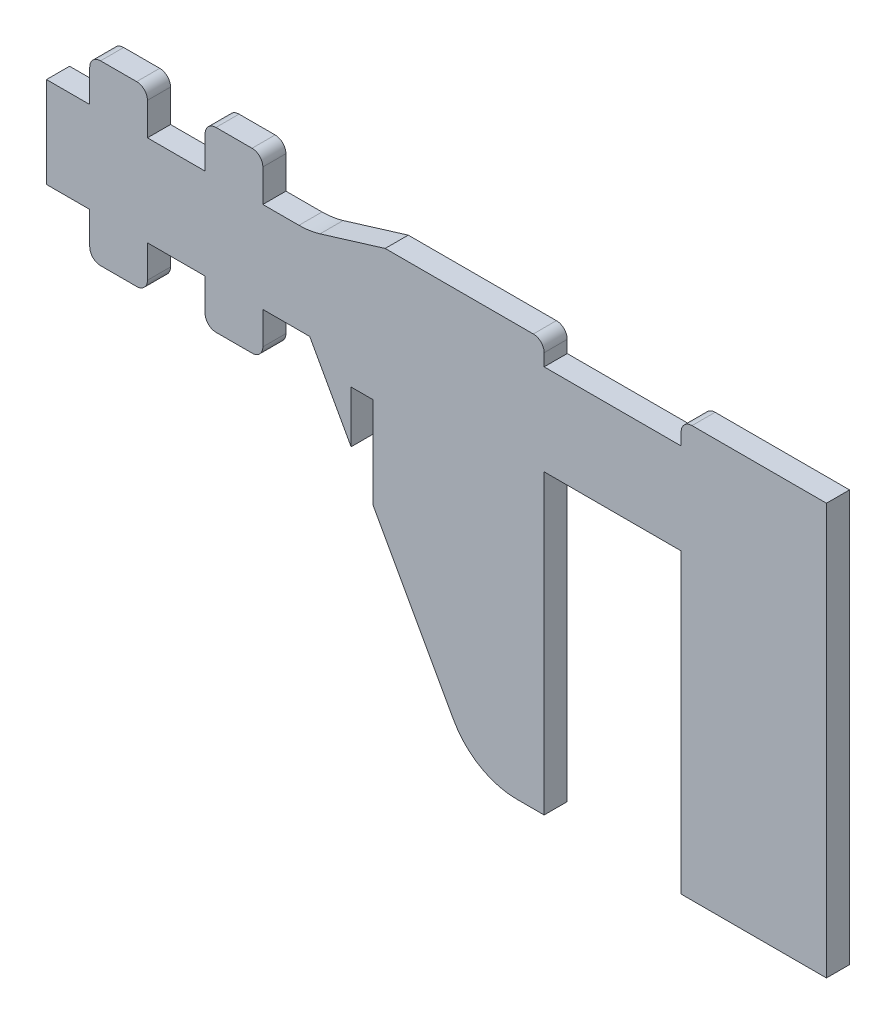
ISO-10303-21;
HEADER;
FILE_DESCRIPTION(('STEP AP214'),'2;1');
FILE_NAME('part.step','',(''),(''),'','','');
FILE_SCHEMA(('AUTOMOTIVE_DESIGN { 1 0 10303 214 1 1 1 1 }'));
ENDSEC;
DATA;
#1=APPLICATION_CONTEXT('core data for automotive mechanical design processes');
#2=APPLICATION_PROTOCOL_DEFINITION('international standard','automotive_design',2000,#1);
#3=PRODUCT_CONTEXT('',#1,'mechanical');
#4=PRODUCT('Part','Part','',(#3));
#5=PRODUCT_RELATED_PRODUCT_CATEGORY('part','',(#4));
#6=PRODUCT_DEFINITION_FORMATION('','',#4);
#7=PRODUCT_DEFINITION_CONTEXT('part definition',#1,'design');
#8=PRODUCT_DEFINITION('design','',#6,#7);
#9=PRODUCT_DEFINITION_SHAPE('','',#8);
#10=(LENGTH_UNIT() NAMED_UNIT(*) SI_UNIT(.MILLI.,.METRE.));
#11=(NAMED_UNIT(*) PLANE_ANGLE_UNIT() SI_UNIT($,.RADIAN.));
#12=(NAMED_UNIT(*) SI_UNIT($,.STERADIAN.) SOLID_ANGLE_UNIT());
#13=UNCERTAINTY_MEASURE_WITH_UNIT(LENGTH_MEASURE(1.E-05),#10,'distance_accuracy_value','');
#14=(GEOMETRIC_REPRESENTATION_CONTEXT(3) GLOBAL_UNCERTAINTY_ASSIGNED_CONTEXT((#13)) GLOBAL_UNIT_ASSIGNED_CONTEXT((#10,
#11,#12)) REPRESENTATION_CONTEXT('',''));
#15=CARTESIAN_POINT('',(0.,0.,0.));
#16=DIRECTION('',(0.,0.,1.));
#17=DIRECTION('',(1.,0.,0.));
#18=AXIS2_PLACEMENT_3D('',#15,#16,#17);
#19=CARTESIAN_POINT('',(8.26033435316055,0.,3.2));
#20=DIRECTION('',(0.875064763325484,0.484005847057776,0.));
#21=DIRECTION('',(-0.484005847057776,0.875064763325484,0.));
#22=AXIS2_PLACEMENT_3D('',#19,#20,#21);
#23=PLANE('',#22);
#24=DIRECTION('',(0.484005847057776,-0.875064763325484,0.));
#25=VECTOR('',#24,1.);
#26=CARTESIAN_POINT('',(8.26033435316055,0.,0.));
#27=LINE('',#26,#25);
#28=CARTESIAN_POINT('',(8.26033435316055,0.,0.));
#29=VERTEX_POINT('',#28);
#30=CARTESIAN_POINT('',(14.,-10.3771043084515,0.));
#31=VERTEX_POINT('',#30);
#32=EDGE_CURVE('E623',#29,#31,#27,.T.);
#33=ORIENTED_EDGE('',*,*,#32,.T.);
#34=DIRECTION('',(0.,0.,1.));
#35=VECTOR('',#34,1.);
#36=CARTESIAN_POINT('',(14.,-10.3771043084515,3.2));
#37=LINE('',#36,#35);
#38=CARTESIAN_POINT('',(14.,-10.3771043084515,3.2));
#39=VERTEX_POINT('',#38);
#40=EDGE_CURVE('E692',#31,#39,#37,.T.);
#41=ORIENTED_EDGE('',*,*,#40,.T.);
#42=DIRECTION('',(0.484005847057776,-0.875064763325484,0.));
#43=VECTOR('',#42,1.);
#44=CARTESIAN_POINT('',(8.26033435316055,0.,3.2));
#45=LINE('',#44,#43);
#46=CARTESIAN_POINT('',(8.26033435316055,0.,3.2));
#47=VERTEX_POINT('',#46);
#48=EDGE_CURVE('E657',#47,#39,#45,.T.);
#49=ORIENTED_EDGE('',*,*,#48,.F.);
#50=DIRECTION('',(0.,0.,-1.));
#51=VECTOR('',#50,1.);
#52=CARTESIAN_POINT('',(8.26033435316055,0.,3.2));
#53=LINE('',#52,#51);
#54=EDGE_CURVE('E413',#47,#29,#53,.T.);
#55=ORIENTED_EDGE('',*,*,#54,.T.);
#56=EDGE_LOOP('',(#33,#41,#49,#55));
#57=FACE_BOUND('',#56,.T.);
#58=ADVANCED_FACE('F33',(#57),#23,.F.);
#59=CARTESIAN_POINT('',(31.0522396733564,-41.2069262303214,3.2));
#60=DIRECTION('',(0.,1.,0.));
#61=DIRECTION('',(0.,0.,1.));
#62=AXIS2_PLACEMENT_3D('',#59,#60,#61);
#63=PLANE('',#62);
#64=DIRECTION('',(1.,0.,0.));
#65=VECTOR('',#64,1.);
#66=CARTESIAN_POINT('',(31.0522396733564,-41.2069262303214,3.2));
#67=LINE('',#66,#65);
#68=CARTESIAN_POINT('',(36.9488792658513,-41.2069262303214,3.2));
#69=VERTEX_POINT('',#68);
#70=CARTESIAN_POINT('',(40.757477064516,-41.2069262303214,3.2));
#71=VERTEX_POINT('',#70);
#72=EDGE_CURVE('E642',#69,#71,#67,.T.);
#73=ORIENTED_EDGE('',*,*,#72,.F.);
#74=DIRECTION('',(0.,0.,-1.));
#75=VECTOR('',#74,1.);
#76=CARTESIAN_POINT('',(36.9488792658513,-41.2069262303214,3.2));
#77=LINE('',#76,#75);
#78=CARTESIAN_POINT('',(36.9488792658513,-41.2069262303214,0.));
#79=VERTEX_POINT('',#78);
#80=EDGE_CURVE('E456',#69,#79,#77,.T.);
#81=ORIENTED_EDGE('',*,*,#80,.T.);
#82=DIRECTION('',(1.,0.,0.));
#83=VECTOR('',#82,1.);
#84=CARTESIAN_POINT('',(31.0522396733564,-41.2069262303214,0.));
#85=LINE('',#84,#83);
#86=CARTESIAN_POINT('',(40.757477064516,-41.2069262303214,0.));
#87=VERTEX_POINT('',#86);
#88=EDGE_CURVE('E366',#79,#87,#85,.T.);
#89=ORIENTED_EDGE('',*,*,#88,.T.);
#90=DIRECTION('',(0.,0.,1.));
#91=VECTOR('',#90,1.);
#92=CARTESIAN_POINT('',(40.757477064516,-41.2069262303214,3.2));
#93=LINE('',#92,#91);
#94=EDGE_CURVE('E651',#87,#71,#93,.T.);
#95=ORIENTED_EDGE('',*,*,#94,.T.);
#96=EDGE_LOOP('',(#73,#81,#89,#95));
#97=FACE_BOUND('',#96,.T.);
#98=ADVANCED_FACE('F648',(#97),#63,.F.);
#99=CARTESIAN_POINT('',(-28.2396656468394,12.6,3.2));
#100=DIRECTION('',(1.,0.,0.));
#101=DIRECTION('',(0.,0.,-1.));
#102=AXIS2_PLACEMENT_3D('',#99,#100,#101);
#103=PLANE('',#102);
#104=DIRECTION('',(0.,-1.,0.));
#105=VECTOR('',#104,1.);
#106=CARTESIAN_POINT('',(-28.2396656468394,12.6,0.));
#107=LINE('',#106,#105);
#108=CARTESIAN_POINT('',(-28.2396656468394,12.6,0.));
#109=VERTEX_POINT('',#108);
#110=CARTESIAN_POINT('',(-28.2396656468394,0.,0.));
#111=VERTEX_POINT('',#110);
#112=EDGE_CURVE('E597',#109,#111,#107,.T.);
#113=ORIENTED_EDGE('',*,*,#112,.T.);
#114=DIRECTION('',(0.,0.,-1.));
#115=VECTOR('',#114,1.);
#116=CARTESIAN_POINT('',(-28.2396656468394,0.,3.2));
#117=LINE('',#116,#115);
#118=CARTESIAN_POINT('',(-28.2396656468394,0.,3.2));
#119=VERTEX_POINT('',#118);
#120=EDGE_CURVE('E428',#119,#111,#117,.T.);
#121=ORIENTED_EDGE('',*,*,#120,.F.);
#122=DIRECTION('',(0.,-1.,0.));
#123=VECTOR('',#122,1.);
#124=CARTESIAN_POINT('',(-28.2396656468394,12.6,3.2));
#125=LINE('',#124,#123);
#126=CARTESIAN_POINT('',(-28.2396656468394,12.6,3.2));
#127=VERTEX_POINT('',#126);
#128=EDGE_CURVE('E395',#127,#119,#125,.T.);
#129=ORIENTED_EDGE('',*,*,#128,.F.);
#130=DIRECTION('',(0.,0.,-1.));
#131=VECTOR('',#130,1.);
#132=CARTESIAN_POINT('',(-28.2396656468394,12.6,3.2));
#133=LINE('',#132,#131);
#134=EDGE_CURVE('E396',#127,#109,#133,.T.);
#135=ORIENTED_EDGE('',*,*,#134,.T.);
#136=EDGE_LOOP('',(#113,#121,#129,#135));
#137=FACE_BOUND('',#136,.T.);
#138=ADVANCED_FACE('F801',(#137),#103,.F.);
#139=CARTESIAN_POINT('',(-28.2396656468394,0.,3.2));
#140=DIRECTION('',(0.,1.,0.));
#141=DIRECTION('',(0.,0.,1.));
#142=AXIS2_PLACEMENT_3D('',#139,#140,#141);
#143=PLANE('',#142);
#144=DIRECTION('',(1.,0.,0.));
#145=VECTOR('',#144,1.);
#146=CARTESIAN_POINT('',(-28.2396656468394,0.,0.));
#147=LINE('',#146,#145);
#148=CARTESIAN_POINT('',(-22.2396656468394,0.,0.));
#149=VERTEX_POINT('',#148);
#150=EDGE_CURVE('E600',#111,#149,#147,.T.);
#151=ORIENTED_EDGE('',*,*,#150,.T.);
#152=DIRECTION('',(0.,0.,-1.));
#153=VECTOR('',#152,1.);
#154=CARTESIAN_POINT('',(-22.2396656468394,0.,3.2));
#155=LINE('',#154,#153);
#156=CARTESIAN_POINT('',(-22.2396656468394,0.,3.2));
#157=VERTEX_POINT('',#156);
#158=EDGE_CURVE('E425',#157,#149,#155,.T.);
#159=ORIENTED_EDGE('',*,*,#158,.F.);
#160=DIRECTION('',(1.,0.,0.));
#161=VECTOR('',#160,1.);
#162=CARTESIAN_POINT('',(-28.2396656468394,0.,3.2));
#163=LINE('',#162,#161);
#164=EDGE_CURVE('E708',#119,#157,#163,.T.);
#165=ORIENTED_EDGE('',*,*,#164,.F.);
#166=ORIENTED_EDGE('',*,*,#120,.T.);
#167=EDGE_LOOP('',(#151,#159,#165,#166));
#168=FACE_BOUND('',#167,.T.);
#169=ADVANCED_FACE('F843',(#168),#143,.F.);
#170=CARTESIAN_POINT('',(-22.2396656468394,0.,3.2));
#171=DIRECTION('',(1.,0.,0.));
#172=DIRECTION('',(0.,1.,0.));
#173=AXIS2_PLACEMENT_3D('',#170,#171,#172);
#174=PLANE('',#173);
#175=DIRECTION('',(0.,-1.,0.));
#176=VECTOR('',#175,1.);
#177=CARTESIAN_POINT('',(-22.2396656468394,0.,0.));
#178=LINE('',#177,#176);
#179=CARTESIAN_POINT('',(-22.2396656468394,-4.5,0.));
#180=VERTEX_POINT('',#179);
#181=EDGE_CURVE('E603',#149,#180,#178,.T.);
#182=ORIENTED_EDGE('',*,*,#181,.T.);
#183=DIRECTION('',(0.,0.,-1.));
#184=VECTOR('',#183,1.);
#185=CARTESIAN_POINT('',(-22.2396656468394,-4.5,3.2));
#186=LINE('',#185,#184);
#187=CARTESIAN_POINT('',(-22.2396656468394,-4.5,3.2));
#188=VERTEX_POINT('',#187);
#189=EDGE_CURVE('E532',#180,#188,#186,.F.);
#190=ORIENTED_EDGE('',*,*,#189,.T.);
#191=DIRECTION('',(0.,-1.,0.));
#192=VECTOR('',#191,1.);
#193=CARTESIAN_POINT('',(-22.2396656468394,0.,3.2));
#194=LINE('',#193,#192);
#195=EDGE_CURVE('E710',#157,#188,#194,.T.);
#196=ORIENTED_EDGE('',*,*,#195,.F.);
#197=ORIENTED_EDGE('',*,*,#158,.T.);
#198=EDGE_LOOP('',(#182,#190,#196,#197));
#199=FACE_BOUND('',#198,.T.);
#200=ADVANCED_FACE('F839',(#199),#174,.F.);
#201=CARTESIAN_POINT('',(-22.2396656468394,-5.99999999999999,3.2));
#202=DIRECTION('',(0.,1.,0.));
#203=DIRECTION('',(0.,0.,1.));
#204=AXIS2_PLACEMENT_3D('',#201,#202,#203);
#205=PLANE('',#204);
#206=DIRECTION('',(1.,0.,0.));
#207=VECTOR('',#206,1.);
#208=CARTESIAN_POINT('',(-22.2396656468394,-5.99999999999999,0.));
#209=LINE('',#208,#207);
#210=CARTESIAN_POINT('',(-20.7396656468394,-5.99999999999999,0.));
#211=VERTEX_POINT('',#210);
#212=CARTESIAN_POINT('',(-15.7396656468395,-5.99999999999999,0.));
#213=VERTEX_POINT('',#212);
#214=EDGE_CURVE('E606',#211,#213,#209,.T.);
#215=ORIENTED_EDGE('',*,*,#214,.T.);
#216=DIRECTION('',(0.,0.,-1.));
#217=VECTOR('',#216,1.);
#218=CARTESIAN_POINT('',(-15.7396656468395,-5.99999999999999,3.2));
#219=LINE('',#218,#217);
#220=CARTESIAN_POINT('',(-15.7396656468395,-5.99999999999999,3.2));
#221=VERTEX_POINT('',#220);
#222=EDGE_CURVE('E528',#213,#221,#219,.F.);
#223=ORIENTED_EDGE('',*,*,#222,.T.);
#224=DIRECTION('',(1.,0.,0.));
#225=VECTOR('',#224,1.);
#226=CARTESIAN_POINT('',(-22.2396656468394,-5.99999999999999,3.2));
#227=LINE('',#226,#225);
#228=CARTESIAN_POINT('',(-20.7396656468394,-5.99999999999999,3.2));
#229=VERTEX_POINT('',#228);
#230=EDGE_CURVE('E713',#229,#221,#227,.T.);
#231=ORIENTED_EDGE('',*,*,#230,.F.);
#232=DIRECTION('',(0.,0.,-1.));
#233=VECTOR('',#232,1.);
#234=CARTESIAN_POINT('',(-20.7396656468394,-5.99999999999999,3.2));
#235=LINE('',#234,#233);
#236=EDGE_CURVE('E525',#229,#211,#235,.T.);
#237=ORIENTED_EDGE('',*,*,#236,.T.);
#238=EDGE_LOOP('',(#215,#223,#231,#237));
#239=FACE_BOUND('',#238,.T.);
#240=ADVANCED_FACE('F835',(#239),#205,.F.);
#241=CARTESIAN_POINT('',(-14.2396656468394,-5.99999999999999,3.2));
#242=DIRECTION('',(-1.,0.,0.));
#243=DIRECTION('',(0.,-1.,0.));
#244=AXIS2_PLACEMENT_3D('',#241,#242,#243);
#245=PLANE('',#244);
#246=DIRECTION('',(0.,1.,0.));
#247=VECTOR('',#246,1.);
#248=CARTESIAN_POINT('',(-14.2396656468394,-5.99999999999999,3.2));
#249=LINE('',#248,#247);
#250=CARTESIAN_POINT('',(-14.2396656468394,-4.5,3.2));
#251=VERTEX_POINT('',#250);
#252=CARTESIAN_POINT('',(-14.2396656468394,0.,3.2));
#253=VERTEX_POINT('',#252);
#254=EDGE_CURVE('E716',#251,#253,#249,.T.);
#255=ORIENTED_EDGE('',*,*,#254,.F.);
#256=DIRECTION('',(0.,0.,-1.));
#257=VECTOR('',#256,1.);
#258=CARTESIAN_POINT('',(-14.2396656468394,-4.5,3.2));
#259=LINE('',#258,#257);
#260=CARTESIAN_POINT('',(-14.2396656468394,-4.5,0.));
#261=VERTEX_POINT('',#260);
#262=EDGE_CURVE('E522',#251,#261,#259,.T.);
#263=ORIENTED_EDGE('',*,*,#262,.T.);
#264=DIRECTION('',(0.,1.,0.));
#265=VECTOR('',#264,1.);
#266=CARTESIAN_POINT('',(-14.2396656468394,-5.99999999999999,0.));
#267=LINE('',#266,#265);
#268=CARTESIAN_POINT('',(-14.2396656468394,0.,0.));
#269=VERTEX_POINT('',#268);
#270=EDGE_CURVE('E609',#261,#269,#267,.T.);
#271=ORIENTED_EDGE('',*,*,#270,.T.);
#272=DIRECTION('',(0.,0.,-1.));
#273=VECTOR('',#272,1.);
#274=CARTESIAN_POINT('',(-14.2396656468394,0.,3.2));
#275=LINE('',#274,#273);
#276=EDGE_CURVE('E422',#253,#269,#275,.T.);
#277=ORIENTED_EDGE('',*,*,#276,.F.);
#278=EDGE_LOOP('',(#255,#263,#271,#277));
#279=FACE_BOUND('',#278,.T.);
#280=ADVANCED_FACE('F831',(#279),#245,.F.);
#281=CARTESIAN_POINT('',(-14.2396656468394,0.,3.2));
#282=DIRECTION('',(0.,1.,0.));
#283=DIRECTION('',(0.,0.,1.));
#284=AXIS2_PLACEMENT_3D('',#281,#282,#283);
#285=PLANE('',#284);
#286=DIRECTION('',(1.,0.,0.));
#287=VECTOR('',#286,1.);
#288=CARTESIAN_POINT('',(-14.2396656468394,0.,0.));
#289=LINE('',#288,#287);
#290=CARTESIAN_POINT('',(-6.23966564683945,0.,0.));
#291=VERTEX_POINT('',#290);
#292=EDGE_CURVE('E611',#269,#291,#289,.T.);
#293=ORIENTED_EDGE('',*,*,#292,.T.);
#294=DIRECTION('',(0.,0.,-1.));
#295=VECTOR('',#294,1.);
#296=CARTESIAN_POINT('',(-6.23966564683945,0.,3.2));
#297=LINE('',#296,#295);
#298=CARTESIAN_POINT('',(-6.23966564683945,0.,3.2));
#299=VERTEX_POINT('',#298);
#300=EDGE_CURVE('E419',#299,#291,#297,.T.);
#301=ORIENTED_EDGE('',*,*,#300,.F.);
#302=DIRECTION('',(1.,0.,0.));
#303=VECTOR('',#302,1.);
#304=CARTESIAN_POINT('',(-14.2396656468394,0.,3.2));
#305=LINE('',#304,#303);
#306=EDGE_CURVE('E718',#253,#299,#305,.T.);
#307=ORIENTED_EDGE('',*,*,#306,.F.);
#308=ORIENTED_EDGE('',*,*,#276,.T.);
#309=EDGE_LOOP('',(#293,#301,#307,#308));
#310=FACE_BOUND('',#309,.T.);
#311=ADVANCED_FACE('F827',(#310),#285,.F.);
#312=CARTESIAN_POINT('',(-6.23966564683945,0.,3.2));
#313=DIRECTION('',(1.,0.,0.));
#314=DIRECTION('',(0.,0.,-1.));
#315=AXIS2_PLACEMENT_3D('',#312,#313,#314);
#316=PLANE('',#315);
#317=DIRECTION('',(0.,-1.,0.));
#318=VECTOR('',#317,1.);
#319=CARTESIAN_POINT('',(-6.23966564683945,0.,0.));
#320=LINE('',#319,#318);
#321=CARTESIAN_POINT('',(-6.23966564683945,-4.5,0.));
#322=VERTEX_POINT('',#321);
#323=EDGE_CURVE('E613',#291,#322,#320,.T.);
#324=ORIENTED_EDGE('',*,*,#323,.T.);
#325=DIRECTION('',(0.,0.,-1.));
#326=VECTOR('',#325,1.);
#327=CARTESIAN_POINT('',(-6.23966564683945,-4.5,3.2));
#328=LINE('',#327,#326);
#329=CARTESIAN_POINT('',(-6.23966564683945,-4.5,3.2));
#330=VERTEX_POINT('',#329);
#331=EDGE_CURVE('E530',#322,#330,#328,.F.);
#332=ORIENTED_EDGE('',*,*,#331,.T.);
#333=DIRECTION('',(0.,-1.,0.));
#334=VECTOR('',#333,1.);
#335=CARTESIAN_POINT('',(-6.23966564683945,0.,3.2));
#336=LINE('',#335,#334);
#337=EDGE_CURVE('E720',#299,#330,#336,.T.);
#338=ORIENTED_EDGE('',*,*,#337,.F.);
#339=ORIENTED_EDGE('',*,*,#300,.T.);
#340=EDGE_LOOP('',(#324,#332,#338,#339));
#341=FACE_BOUND('',#340,.T.);
#342=ADVANCED_FACE('F823',(#341),#316,.F.);
#343=CARTESIAN_POINT('',(-6.23966564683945,-5.99999999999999,3.2));
#344=DIRECTION('',(0.,1.,0.));
#345=DIRECTION('',(0.,0.,1.));
#346=AXIS2_PLACEMENT_3D('',#343,#344,#345);
#347=PLANE('',#346);
#348=DIRECTION('',(1.,0.,0.));
#349=VECTOR('',#348,1.);
#350=CARTESIAN_POINT('',(-6.23966564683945,-5.99999999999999,0.));
#351=LINE('',#350,#349);
#352=CARTESIAN_POINT('',(-4.73966564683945,-5.99999999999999,0.));
#353=VERTEX_POINT('',#352);
#354=CARTESIAN_POINT('',(0.26033435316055,-5.99999999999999,0.));
#355=VERTEX_POINT('',#354);
#356=EDGE_CURVE('E616',#353,#355,#351,.T.);
#357=ORIENTED_EDGE('',*,*,#356,.T.);
#358=DIRECTION('',(0.,0.,-1.));
#359=VECTOR('',#358,1.);
#360=CARTESIAN_POINT('',(0.26033435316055,-5.99999999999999,3.2));
#361=LINE('',#360,#359);
#362=CARTESIAN_POINT('',(0.26033435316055,-5.99999999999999,3.2));
#363=VERTEX_POINT('',#362);
#364=EDGE_CURVE('E520',#355,#363,#361,.F.);
#365=ORIENTED_EDGE('',*,*,#364,.T.);
#366=DIRECTION('',(1.,0.,0.));
#367=VECTOR('',#366,1.);
#368=CARTESIAN_POINT('',(-6.23966564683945,-5.99999999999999,3.2));
#369=LINE('',#368,#367);
#370=CARTESIAN_POINT('',(-4.73966564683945,-5.99999999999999,3.2));
#371=VERTEX_POINT('',#370);
#372=EDGE_CURVE('E723',#371,#363,#369,.T.);
#373=ORIENTED_EDGE('',*,*,#372,.F.);
#374=DIRECTION('',(0.,0.,-1.));
#375=VECTOR('',#374,1.);
#376=CARTESIAN_POINT('',(-4.73966564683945,-5.99999999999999,3.2));
#377=LINE('',#376,#375);
#378=EDGE_CURVE('E517',#371,#353,#377,.T.);
#379=ORIENTED_EDGE('',*,*,#378,.T.);
#380=EDGE_LOOP('',(#357,#365,#373,#379));
#381=FACE_BOUND('',#380,.T.);
#382=ADVANCED_FACE('F817',(#381),#347,.F.);
#383=CARTESIAN_POINT('',(1.76033435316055,-5.99999999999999,3.2));
#384=DIRECTION('',(-1.,0.,0.));
#385=DIRECTION('',(0.,0.,1.));
#386=AXIS2_PLACEMENT_3D('',#383,#384,#385);
#387=PLANE('',#386);
#388=DIRECTION('',(0.,1.,0.));
#389=VECTOR('',#388,1.);
#390=CARTESIAN_POINT('',(1.76033435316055,-5.99999999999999,3.2));
#391=LINE('',#390,#389);
#392=CARTESIAN_POINT('',(1.76033435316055,-4.5,3.2));
#393=VERTEX_POINT('',#392);
#394=CARTESIAN_POINT('',(1.76033435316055,0.,3.2));
#395=VERTEX_POINT('',#394);
#396=EDGE_CURVE('E726',#393,#395,#391,.T.);
#397=ORIENTED_EDGE('',*,*,#396,.F.);
#398=DIRECTION('',(0.,0.,-1.));
#399=VECTOR('',#398,1.);
#400=CARTESIAN_POINT('',(1.76033435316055,-4.5,3.2));
#401=LINE('',#400,#399);
#402=CARTESIAN_POINT('',(1.76033435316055,-4.5,0.));
#403=VERTEX_POINT('',#402);
#404=EDGE_CURVE('E514',#393,#403,#401,.T.);
#405=ORIENTED_EDGE('',*,*,#404,.T.);
#406=DIRECTION('',(0.,1.,0.));
#407=VECTOR('',#406,1.);
#408=CARTESIAN_POINT('',(1.76033435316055,-5.99999999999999,0.));
#409=LINE('',#408,#407);
#410=CARTESIAN_POINT('',(1.76033435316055,0.,0.));
#411=VERTEX_POINT('',#410);
#412=EDGE_CURVE('E619',#403,#411,#409,.T.);
#413=ORIENTED_EDGE('',*,*,#412,.T.);
#414=DIRECTION('',(0.,0.,-1.));
#415=VECTOR('',#414,1.);
#416=CARTESIAN_POINT('',(1.76033435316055,0.,3.2));
#417=LINE('',#416,#415);
#418=EDGE_CURVE('E416',#395,#411,#417,.T.);
#419=ORIENTED_EDGE('',*,*,#418,.F.);
#420=EDGE_LOOP('',(#397,#405,#413,#419));
#421=FACE_BOUND('',#420,.T.);
#422=ADVANCED_FACE('F812',(#421),#387,.F.);
#423=CARTESIAN_POINT('',(1.76033435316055,0.,3.2));
#424=DIRECTION('',(0.,1.,0.));
#425=DIRECTION('',(0.,0.,1.));
#426=AXIS2_PLACEMENT_3D('',#423,#424,#425);
#427=PLANE('',#426);
#428=DIRECTION('',(1.,0.,0.));
#429=VECTOR('',#428,1.);
#430=CARTESIAN_POINT('',(1.76033435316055,0.,0.));
#431=LINE('',#430,#429);
#432=EDGE_CURVE('E621',#411,#29,#431,.T.);
#433=ORIENTED_EDGE('',*,*,#432,.T.);
#434=ORIENTED_EDGE('',*,*,#54,.F.);
#435=DIRECTION('',(1.,0.,0.));
#436=VECTOR('',#435,1.);
#437=CARTESIAN_POINT('',(1.76033435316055,0.,3.2));
#438=LINE('',#437,#436);
#439=EDGE_CURVE('E727',#395,#47,#438,.T.);
#440=ORIENTED_EDGE('',*,*,#439,.F.);
#441=ORIENTED_EDGE('',*,*,#418,.T.);
#442=EDGE_LOOP('',(#433,#434,#440,#441));
#443=FACE_BOUND('',#442,.T.);
#444=ADVANCED_FACE('F806',(#443),#427,.F.);
#445=CARTESIAN_POINT('',(17.,-15.8009939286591,0.));
#446=VERTEX_POINT('',#445);
#447=CARTESIAN_POINT('',(28.1982316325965,-36.0469847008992,0.));
#448=VERTEX_POINT('',#447);
#449=EDGE_CURVE('E622',#446,#448,#27,.T.);
#450=ORIENTED_EDGE('',*,*,#449,.T.);
#451=DIRECTION('',(0.,0.,-1.));
#452=VECTOR('',#451,1.);
#453=CARTESIAN_POINT('',(28.1982316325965,-36.0469847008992,3.2));
#454=LINE('',#453,#452);
#455=CARTESIAN_POINT('',(28.1982316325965,-36.0469847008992,3.2));
#456=VERTEX_POINT('',#455);
#457=EDGE_CURVE('E461',#448,#456,#454,.F.);
#458=ORIENTED_EDGE('',*,*,#457,.T.);
#459=CARTESIAN_POINT('',(17.,-15.8009939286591,3.2));
#460=VERTEX_POINT('',#459);
#461=EDGE_CURVE('E645',#460,#456,#45,.T.);
#462=ORIENTED_EDGE('',*,*,#461,.F.);
#463=DIRECTION('',(0.,0.,-1.));
#464=VECTOR('',#463,1.);
#465=CARTESIAN_POINT('',(17.,-15.8009939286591,3.2));
#466=LINE('',#465,#464);
#467=EDGE_CURVE('E636',#460,#446,#466,.T.);
#468=ORIENTED_EDGE('',*,*,#467,.T.);
#469=EDGE_LOOP('',(#450,#458,#462,#468));
#470=FACE_BOUND('',#469,.T.);
#471=ADVANCED_FACE('F633',(#470),#23,.F.);
#472=CARTESIAN_POINT('',(59.757477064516,-41.2069262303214,3.2));
#473=VERTEX_POINT('',#472);
#474=CARTESIAN_POINT('',(79.8975751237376,-41.2069262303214,3.2));
#475=VERTEX_POINT('',#474);
#476=EDGE_CURVE('E653',#473,#475,#67,.T.);
#477=ORIENTED_EDGE('',*,*,#476,.F.);
#478=DIRECTION('',(0.,0.,-1.));
#479=VECTOR('',#478,1.);
#480=CARTESIAN_POINT('',(59.757477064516,-41.2069262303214,3.2));
#481=LINE('',#480,#479);
#482=CARTESIAN_POINT('',(59.757477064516,-41.2069262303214,0.));
#483=VERTEX_POINT('',#482);
#484=EDGE_CURVE('E747',#473,#483,#481,.T.);
#485=ORIENTED_EDGE('',*,*,#484,.T.);
#486=CARTESIAN_POINT('',(79.8975751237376,-41.2069262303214,0.));
#487=VERTEX_POINT('',#486);
#488=EDGE_CURVE('E370',#483,#487,#85,.T.);
#489=ORIENTED_EDGE('',*,*,#488,.T.);
#490=DIRECTION('',(0.,0.,-1.));
#491=VECTOR('',#490,1.);
#492=CARTESIAN_POINT('',(79.8975751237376,-41.2069262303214,3.2));
#493=LINE('',#492,#491);
#494=EDGE_CURVE('E364',#475,#487,#493,.T.);
#495=ORIENTED_EDGE('',*,*,#494,.F.);
#496=EDGE_LOOP('',(#477,#485,#489,#495));
#497=FACE_BOUND('',#496,.T.);
#498=ADVANCED_FACE('F803',(#497),#63,.F.);
#499=CARTESIAN_POINT('',(79.8975751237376,-41.2069262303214,3.2));
#500=DIRECTION('',(-1.,0.,0.));
#501=DIRECTION('',(0.,0.,1.));
#502=AXIS2_PLACEMENT_3D('',#499,#500,#501);
#503=PLANE('',#502);
#504=DIRECTION('',(0.,1.,0.));
#505=VECTOR('',#504,1.);
#506=CARTESIAN_POINT('',(79.8975751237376,-41.2069262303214,0.));
#507=LINE('',#506,#505);
#508=CARTESIAN_POINT('',(79.8975751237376,15.8,0.));
#509=VERTEX_POINT('',#508);
#510=EDGE_CURVE('E356',#487,#509,#507,.T.);
#511=ORIENTED_EDGE('',*,*,#510,.T.);
#512=DIRECTION('',(0.,0.,-1.));
#513=VECTOR('',#512,1.);
#514=CARTESIAN_POINT('',(79.8975751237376,15.8,10.));
#515=LINE('',#514,#513);
#516=CARTESIAN_POINT('',(79.8975751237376,15.8,3.2));
#517=VERTEX_POINT('',#516);
#518=EDGE_CURVE('E339',#517,#509,#515,.T.);
#519=ORIENTED_EDGE('',*,*,#518,.F.);
#520=DIRECTION('',(0.,1.,0.));
#521=VECTOR('',#520,1.);
#522=CARTESIAN_POINT('',(79.8975751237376,-41.2069262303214,3.2));
#523=LINE('',#522,#521);
#524=EDGE_CURVE('E652',#475,#517,#523,.T.);
#525=ORIENTED_EDGE('',*,*,#524,.F.);
#526=ORIENTED_EDGE('',*,*,#494,.T.);
#527=EDGE_LOOP('',(#511,#519,#525,#526));
#528=FACE_BOUND('',#527,.T.);
#529=ADVANCED_FACE('F362',(#528),#503,.F.);
#530=CARTESIAN_POINT('',(79.8975751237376,34.5179963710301,3.2));
#531=DIRECTION('',(0.29257060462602,-0.956243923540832,0.));
#532=DIRECTION('',(0.956243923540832,0.29257060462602,0.));
#533=AXIS2_PLACEMENT_3D('',#530,#531,#532);
#534=PLANE('',#533);
#535=DIRECTION('',(-0.956243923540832,-0.29257060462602,0.));
#536=VECTOR('',#535,1.);
#537=CARTESIAN_POINT('',(79.8975751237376,34.5179963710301,3.2));
#538=LINE('',#537,#536);
#539=CARTESIAN_POINT('',(18.7192817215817,15.8,3.2));
#540=VERTEX_POINT('',#539);
#541=CARTESIAN_POINT('',(9.69046716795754,13.0375607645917,3.2));
#542=VERTEX_POINT('',#541);
#543=EDGE_CURVE('E655',#540,#542,#538,.T.);
#544=ORIENTED_EDGE('',*,*,#543,.F.);
#545=DIRECTION('',(0.,0.,-1.));
#546=VECTOR('',#545,1.);
#547=CARTESIAN_POINT('',(18.7192817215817,15.8,3.2));
#548=LINE('',#547,#546);
#549=CARTESIAN_POINT('',(18.7192817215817,15.8,0.));
#550=VERTEX_POINT('',#549);
#551=EDGE_CURVE('E771',#540,#550,#548,.T.);
#552=ORIENTED_EDGE('',*,*,#551,.T.);
#553=DIRECTION('',(-0.956243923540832,-0.29257060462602,0.));
#554=VECTOR('',#553,1.);
#555=CARTESIAN_POINT('',(79.8975751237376,34.5179963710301,0.));
#556=LINE('',#555,#554);
#557=CARTESIAN_POINT('',(9.69046716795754,13.0375607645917,0.));
#558=VERTEX_POINT('',#557);
#559=EDGE_CURVE('E365',#550,#558,#556,.T.);
#560=ORIENTED_EDGE('',*,*,#559,.T.);
#561=DIRECTION('',(0.,0.,-1.));
#562=VECTOR('',#561,1.);
#563=CARTESIAN_POINT('',(9.69046716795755,13.0375607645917,3.2));
#564=LINE('',#563,#562);
#565=EDGE_CURVE('E434',#558,#542,#564,.F.);
#566=ORIENTED_EDGE('',*,*,#565,.T.);
#567=EDGE_LOOP('',(#544,#552,#560,#566));
#568=FACE_BOUND('',#567,.T.);
#569=ADVANCED_FACE('F669',(#568),#534,.F.);
#570=CARTESIAN_POINT('',(8.26033435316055,12.6,3.2));
#571=DIRECTION('',(0.,-1.,0.));
#572=DIRECTION('',(1.,0.,0.));
#573=AXIS2_PLACEMENT_3D('',#570,#571,#572);
#574=PLANE('',#573);
#575=DIRECTION('',(-1.,0.,0.));
#576=VECTOR('',#575,1.);
#577=CARTESIAN_POINT('',(8.26033435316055,12.6,3.2));
#578=LINE('',#577,#576);
#579=CARTESIAN_POINT('',(6.76476112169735,12.6,3.2));
#580=VERTEX_POINT('',#579);
#581=CARTESIAN_POINT('',(1.76033435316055,12.6,3.2));
#582=VERTEX_POINT('',#581);
#583=EDGE_CURVE('E562',#580,#582,#578,.T.);
#584=ORIENTED_EDGE('',*,*,#583,.F.);
#585=DIRECTION('',(0.,0.,-1.));
#586=VECTOR('',#585,1.);
#587=CARTESIAN_POINT('',(6.76476112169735,12.6,0.));
#588=LINE('',#587,#586);
#589=CARTESIAN_POINT('',(6.76476112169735,12.6,0.));
#590=VERTEX_POINT('',#589);
#591=EDGE_CURVE('E431',#580,#590,#588,.T.);
#592=ORIENTED_EDGE('',*,*,#591,.T.);
#593=DIRECTION('',(-1.,0.,0.));
#594=VECTOR('',#593,1.);
#595=CARTESIAN_POINT('',(8.26033435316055,12.6,0.));
#596=LINE('',#595,#594);
#597=CARTESIAN_POINT('',(1.76033435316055,12.6,0.));
#598=VERTEX_POINT('',#597);
#599=EDGE_CURVE('E368',#590,#598,#596,.T.);
#600=ORIENTED_EDGE('',*,*,#599,.T.);
#601=DIRECTION('',(0.,0.,-1.));
#602=VECTOR('',#601,1.);
#603=CARTESIAN_POINT('',(1.76033435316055,12.6,3.2));
#604=LINE('',#603,#602);
#605=EDGE_CURVE('E409',#582,#598,#604,.T.);
#606=ORIENTED_EDGE('',*,*,#605,.F.);
#607=EDGE_LOOP('',(#584,#592,#600,#606));
#608=FACE_BOUND('',#607,.T.);
#609=ADVANCED_FACE('F676',(#608),#574,.F.);
#610=CARTESIAN_POINT('',(1.76033435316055,12.6,3.2));
#611=DIRECTION('',(-1.,0.,0.));
#612=DIRECTION('',(0.,0.,1.));
#613=AXIS2_PLACEMENT_3D('',#610,#611,#612);
#614=PLANE('',#613);
#615=DIRECTION('',(0.,1.,0.));
#616=VECTOR('',#615,1.);
#617=CARTESIAN_POINT('',(1.76033435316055,12.6,0.));
#618=LINE('',#617,#616);
#619=CARTESIAN_POINT('',(1.76033435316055,17.1,0.));
#620=VERTEX_POINT('',#619);
#621=EDGE_CURVE('E375',#598,#620,#618,.T.);
#622=ORIENTED_EDGE('',*,*,#621,.T.);
#623=DIRECTION('',(0.,0.,-1.));
#624=VECTOR('',#623,1.);
#625=CARTESIAN_POINT('',(1.76033435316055,17.1,3.2));
#626=LINE('',#625,#624);
#627=CARTESIAN_POINT('',(1.76033435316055,17.1,3.2));
#628=VERTEX_POINT('',#627);
#629=EDGE_CURVE('E41',#620,#628,#626,.F.);
#630=ORIENTED_EDGE('',*,*,#629,.T.);
#631=DIRECTION('',(0.,1.,0.));
#632=VECTOR('',#631,1.);
#633=CARTESIAN_POINT('',(1.76033435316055,12.6,3.2));
#634=LINE('',#633,#632);
#635=EDGE_CURVE('E553',#582,#628,#634,.T.);
#636=ORIENTED_EDGE('',*,*,#635,.F.);
#637=ORIENTED_EDGE('',*,*,#605,.T.);
#638=EDGE_LOOP('',(#622,#630,#636,#637));
#639=FACE_BOUND('',#638,.T.);
#640=ADVANCED_FACE('F552',(#639),#614,.F.);
#641=CARTESIAN_POINT('',(1.76033435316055,18.6,3.2));
#642=DIRECTION('',(0.,-1.,0.));
#643=DIRECTION('',(1.,0.,0.));
#644=AXIS2_PLACEMENT_3D('',#641,#642,#643);
#645=PLANE('',#644);
#646=DIRECTION('',(-1.,0.,0.));
#647=VECTOR('',#646,1.);
#648=CARTESIAN_POINT('',(1.76033435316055,18.6,3.2));
#649=LINE('',#648,#647);
#650=CARTESIAN_POINT('',(0.260334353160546,18.6,3.2));
#651=VERTEX_POINT('',#650);
#652=CARTESIAN_POINT('',(-4.73966564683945,18.6,3.2));
#653=VERTEX_POINT('',#652);
#654=EDGE_CURVE('E564',#651,#653,#649,.T.);
#655=ORIENTED_EDGE('',*,*,#654,.F.);
#656=DIRECTION('',(0.,0.,-1.));
#657=VECTOR('',#656,1.);
#658=CARTESIAN_POINT('',(0.260334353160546,18.6,3.2));
#659=LINE('',#658,#657);
#660=CARTESIAN_POINT('',(0.260334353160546,18.6,0.));
#661=VERTEX_POINT('',#660);
#662=EDGE_CURVE('E546',#651,#661,#659,.T.);
#663=ORIENTED_EDGE('',*,*,#662,.T.);
#664=DIRECTION('',(-1.,0.,0.));
#665=VECTOR('',#664,1.);
#666=CARTESIAN_POINT('',(1.76033435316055,18.6,0.));
#667=LINE('',#666,#665);
#668=CARTESIAN_POINT('',(-4.73966564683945,18.6,0.));
#669=VERTEX_POINT('',#668);
#670=EDGE_CURVE('E378',#661,#669,#667,.T.);
#671=ORIENTED_EDGE('',*,*,#670,.T.);
#672=DIRECTION('',(0.,0.,-1.));
#673=VECTOR('',#672,1.);
#674=CARTESIAN_POINT('',(-4.73966564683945,18.6,3.2));
#675=LINE('',#674,#673);
#676=EDGE_CURVE('E544',#669,#653,#675,.F.);
#677=ORIENTED_EDGE('',*,*,#676,.T.);
#678=EDGE_LOOP('',(#655,#663,#671,#677));
#679=FACE_BOUND('',#678,.T.);
#680=ADVANCED_FACE('F570',(#679),#645,.F.);
#681=CARTESIAN_POINT('',(-6.23966564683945,18.6,3.2));
#682=DIRECTION('',(1.,0.,0.));
#683=DIRECTION('',(0.,0.,-1.));
#684=AXIS2_PLACEMENT_3D('',#681,#682,#683);
#685=PLANE('',#684);
#686=DIRECTION('',(0.,-1.,0.));
#687=VECTOR('',#686,1.);
#688=CARTESIAN_POINT('',(-6.23966564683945,18.6,3.2));
#689=LINE('',#688,#687);
#690=CARTESIAN_POINT('',(-6.23966564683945,17.1,3.2));
#691=VERTEX_POINT('',#690);
#692=CARTESIAN_POINT('',(-6.23966564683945,12.6,3.2));
#693=VERTEX_POINT('',#692);
#694=EDGE_CURVE('E581',#691,#693,#689,.T.);
#695=ORIENTED_EDGE('',*,*,#694,.F.);
#696=DIRECTION('',(0.,0.,-1.));
#697=VECTOR('',#696,1.);
#698=CARTESIAN_POINT('',(-6.23966564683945,17.1,3.2));
#699=LINE('',#698,#697);
#700=CARTESIAN_POINT('',(-6.23966564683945,17.1,0.));
#701=VERTEX_POINT('',#700);
#702=EDGE_CURVE('E11',#691,#701,#699,.T.);
#703=ORIENTED_EDGE('',*,*,#702,.T.);
#704=DIRECTION('',(0.,-1.,0.));
#705=VECTOR('',#704,1.);
#706=CARTESIAN_POINT('',(-6.23966564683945,18.6,0.));
#707=LINE('',#706,#705);
#708=CARTESIAN_POINT('',(-6.23966564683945,12.6,0.));
#709=VERTEX_POINT('',#708);
#710=EDGE_CURVE('E381',#701,#709,#707,.T.);
#711=ORIENTED_EDGE('',*,*,#710,.T.);
#712=DIRECTION('',(0.,0.,-1.));
#713=VECTOR('',#712,1.);
#714=CARTESIAN_POINT('',(-6.23966564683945,12.6,3.2));
#715=LINE('',#714,#713);
#716=EDGE_CURVE('E406',#693,#709,#715,.T.);
#717=ORIENTED_EDGE('',*,*,#716,.F.);
#718=EDGE_LOOP('',(#695,#703,#711,#717));
#719=FACE_BOUND('',#718,.T.);
#720=ADVANCED_FACE('F579',(#719),#685,.F.);
#721=CARTESIAN_POINT('',(-6.23966564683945,12.6,3.2));
#722=DIRECTION('',(0.,-1.,0.));
#723=DIRECTION('',(1.,0.,0.));
#724=AXIS2_PLACEMENT_3D('',#721,#722,#723);
#725=PLANE('',#724);
#726=DIRECTION('',(-1.,0.,0.));
#727=VECTOR('',#726,1.);
#728=CARTESIAN_POINT('',(-6.23966564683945,12.6,0.));
#729=LINE('',#728,#727);
#730=CARTESIAN_POINT('',(-14.2396656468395,12.6,0.));
#731=VERTEX_POINT('',#730);
#732=EDGE_CURVE('E383',#709,#731,#729,.T.);
#733=ORIENTED_EDGE('',*,*,#732,.T.);
#734=DIRECTION('',(0.,0.,-1.));
#735=VECTOR('',#734,1.);
#736=CARTESIAN_POINT('',(-14.2396656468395,12.6,3.2));
#737=LINE('',#736,#735);
#738=CARTESIAN_POINT('',(-14.2396656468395,12.6,3.2));
#739=VERTEX_POINT('',#738);
#740=EDGE_CURVE('E403',#739,#731,#737,.T.);
#741=ORIENTED_EDGE('',*,*,#740,.F.);
#742=DIRECTION('',(-1.,0.,0.));
#743=VECTOR('',#742,1.);
#744=CARTESIAN_POINT('',(-6.23966564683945,12.6,3.2));
#745=LINE('',#744,#743);
#746=EDGE_CURVE('E583',#693,#739,#745,.T.);
#747=ORIENTED_EDGE('',*,*,#746,.F.);
#748=ORIENTED_EDGE('',*,*,#716,.T.);
#749=EDGE_LOOP('',(#733,#741,#747,#748));
#750=FACE_BOUND('',#749,.T.);
#751=ADVANCED_FACE('F1027',(#750),#725,.F.);
#752=CARTESIAN_POINT('',(-14.2396656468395,12.6,3.2));
#753=DIRECTION('',(-1.,0.,0.));
#754=DIRECTION('',(0.,-1.,0.));
#755=AXIS2_PLACEMENT_3D('',#752,#753,#754);
#756=PLANE('',#755);
#757=DIRECTION('',(0.,1.,0.));
#758=VECTOR('',#757,1.);
#759=CARTESIAN_POINT('',(-14.2396656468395,12.6,0.));
#760=LINE('',#759,#758);
#761=CARTESIAN_POINT('',(-14.2396656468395,17.1,0.));
#762=VERTEX_POINT('',#761);
#763=EDGE_CURVE('E385',#731,#762,#760,.T.);
#764=ORIENTED_EDGE('',*,*,#763,.T.);
#765=DIRECTION('',(0.,0.,-1.));
#766=VECTOR('',#765,1.);
#767=CARTESIAN_POINT('',(-14.2396656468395,17.1,3.2));
#768=LINE('',#767,#766);
#769=CARTESIAN_POINT('',(-14.2396656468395,17.1,3.2));
#770=VERTEX_POINT('',#769);
#771=EDGE_CURVE('E542',#762,#770,#768,.F.);
#772=ORIENTED_EDGE('',*,*,#771,.T.);
#773=DIRECTION('',(0.,1.,0.));
#774=VECTOR('',#773,1.);
#775=CARTESIAN_POINT('',(-14.2396656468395,12.6,3.2));
#776=LINE('',#775,#774);
#777=EDGE_CURVE('E585',#739,#770,#776,.T.);
#778=ORIENTED_EDGE('',*,*,#777,.F.);
#779=ORIENTED_EDGE('',*,*,#740,.T.);
#780=EDGE_LOOP('',(#764,#772,#778,#779));
#781=FACE_BOUND('',#780,.T.);
#782=ADVANCED_FACE('F1017',(#781),#756,.F.);
#783=CARTESIAN_POINT('',(-14.2396656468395,18.6,3.2));
#784=DIRECTION('',(0.,-1.,0.));
#785=DIRECTION('',(1.,0.,0.));
#786=AXIS2_PLACEMENT_3D('',#783,#784,#785);
#787=PLANE('',#786);
#788=DIRECTION('',(-1.,0.,0.));
#789=VECTOR('',#788,1.);
#790=CARTESIAN_POINT('',(-14.2396656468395,18.6,0.));
#791=LINE('',#790,#789);
#792=CARTESIAN_POINT('',(-15.7396656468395,18.6,0.));
#793=VERTEX_POINT('',#792);
#794=CARTESIAN_POINT('',(-20.7396656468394,18.6,0.));
#795=VERTEX_POINT('',#794);
#796=EDGE_CURVE('E388',#793,#795,#791,.T.);
#797=ORIENTED_EDGE('',*,*,#796,.T.);
#798=DIRECTION('',(0.,0.,-1.));
#799=VECTOR('',#798,1.);
#800=CARTESIAN_POINT('',(-20.7396656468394,18.6,3.2));
#801=LINE('',#800,#799);
#802=CARTESIAN_POINT('',(-20.7396656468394,18.6,3.2));
#803=VERTEX_POINT('',#802);
#804=EDGE_CURVE('E540',#795,#803,#801,.F.);
#805=ORIENTED_EDGE('',*,*,#804,.T.);
#806=DIRECTION('',(-1.,0.,0.));
#807=VECTOR('',#806,1.);
#808=CARTESIAN_POINT('',(-14.2396656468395,18.6,3.2));
#809=LINE('',#808,#807);
#810=CARTESIAN_POINT('',(-15.7396656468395,18.6,3.2));
#811=VERTEX_POINT('',#810);
#812=EDGE_CURVE('E591',#811,#803,#809,.T.);
#813=ORIENTED_EDGE('',*,*,#812,.F.);
#814=DIRECTION('',(0.,0.,-1.));
#815=VECTOR('',#814,1.);
#816=CARTESIAN_POINT('',(-15.7396656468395,18.6,3.2));
#817=LINE('',#816,#815);
#818=EDGE_CURVE('E537',#811,#793,#817,.T.);
#819=ORIENTED_EDGE('',*,*,#818,.T.);
#820=EDGE_LOOP('',(#797,#805,#813,#819));
#821=FACE_BOUND('',#820,.T.);
#822=ADVANCED_FACE('F1007',(#821),#787,.F.);
#823=CARTESIAN_POINT('',(-22.2396656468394,18.6,3.2));
#824=DIRECTION('',(1.,0.,0.));
#825=DIRECTION('',(0.,0.,-1.));
#826=AXIS2_PLACEMENT_3D('',#823,#824,#825);
#827=PLANE('',#826);
#828=DIRECTION('',(0.,-1.,0.));
#829=VECTOR('',#828,1.);
#830=CARTESIAN_POINT('',(-22.2396656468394,18.6,3.2));
#831=LINE('',#830,#829);
#832=CARTESIAN_POINT('',(-22.2396656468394,17.1,3.2));
#833=VERTEX_POINT('',#832);
#834=CARTESIAN_POINT('',(-22.2396656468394,12.6,3.2));
#835=VERTEX_POINT('',#834);
#836=EDGE_CURVE('E594',#833,#835,#831,.T.);
#837=ORIENTED_EDGE('',*,*,#836,.F.);
#838=DIRECTION('',(0.,0.,-1.));
#839=VECTOR('',#838,1.);
#840=CARTESIAN_POINT('',(-22.2396656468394,17.1,3.2));
#841=LINE('',#840,#839);
#842=CARTESIAN_POINT('',(-22.2396656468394,17.1,0.));
#843=VERTEX_POINT('',#842);
#844=EDGE_CURVE('E534',#833,#843,#841,.T.);
#845=ORIENTED_EDGE('',*,*,#844,.T.);
#846=DIRECTION('',(0.,-1.,0.));
#847=VECTOR('',#846,1.);
#848=CARTESIAN_POINT('',(-22.2396656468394,18.6,0.));
#849=LINE('',#848,#847);
#850=CARTESIAN_POINT('',(-22.2396656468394,12.6,0.));
#851=VERTEX_POINT('',#850);
#852=EDGE_CURVE('E391',#843,#851,#849,.T.);
#853=ORIENTED_EDGE('',*,*,#852,.T.);
#854=DIRECTION('',(0.,0.,-1.));
#855=VECTOR('',#854,1.);
#856=CARTESIAN_POINT('',(-22.2396656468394,12.6,3.2));
#857=LINE('',#856,#855);
#858=EDGE_CURVE('E399',#835,#851,#857,.T.);
#859=ORIENTED_EDGE('',*,*,#858,.F.);
#860=EDGE_LOOP('',(#837,#845,#853,#859));
#861=FACE_BOUND('',#860,.T.);
#862=ADVANCED_FACE('F1002',(#861),#827,.F.);
#863=CARTESIAN_POINT('',(-22.2396656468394,12.6,3.2));
#864=DIRECTION('',(0.,-1.,0.));
#865=DIRECTION('',(1.,0.,0.));
#866=AXIS2_PLACEMENT_3D('',#863,#864,#865);
#867=PLANE('',#866);
#868=DIRECTION('',(-1.,0.,0.));
#869=VECTOR('',#868,1.);
#870=CARTESIAN_POINT('',(-22.2396656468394,12.6,0.));
#871=LINE('',#870,#869);
#872=EDGE_CURVE('E393',#851,#109,#871,.T.);
#873=ORIENTED_EDGE('',*,*,#872,.T.);
#874=ORIENTED_EDGE('',*,*,#134,.F.);
#875=DIRECTION('',(-1.,0.,0.));
#876=VECTOR('',#875,1.);
#877=CARTESIAN_POINT('',(-22.2396656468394,12.6,3.2));
#878=LINE('',#877,#876);
#879=EDGE_CURVE('E400',#835,#127,#878,.T.);
#880=ORIENTED_EDGE('',*,*,#879,.F.);
#881=ORIENTED_EDGE('',*,*,#858,.T.);
#882=EDGE_LOOP('',(#873,#874,#880,#881));
#883=FACE_BOUND('',#882,.T.);
#884=ADVANCED_FACE('F995',(#883),#867,.F.);
#885=CARTESIAN_POINT('',(0.,0.,3.2));
#886=DIRECTION('',(0.,0.,1.));
#887=DIRECTION('',(1.,0.,0.));
#888=AXIS2_PLACEMENT_3D('',#885,#886,#887);
#889=PLANE('',#888);
#890=DIRECTION('',(1.,0.,0.));
#891=VECTOR('',#890,1.);
#892=CARTESIAN_POINT('',(0.,15.8,3.2));
#893=LINE('',#892,#891);
#894=CARTESIAN_POINT('',(61.257477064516,15.8,3.2));
#895=VERTEX_POINT('',#894);
#896=EDGE_CURVE('E346',#895,#517,#893,.T.);
#897=ORIENTED_EDGE('',*,*,#896,.F.);
#898=CARTESIAN_POINT('',(61.257477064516,14.3,3.2));
#899=DIRECTION('',(0.,0.,1.));
#900=DIRECTION('',(1.,0.,0.));
#901=AXIS2_PLACEMENT_3D('',#898,#899,#900);
#902=CIRCLE('',#901,1.5);
#903=CARTESIAN_POINT('',(59.757477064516,14.3,3.2));
#904=VERTEX_POINT('',#903);
#905=EDGE_CURVE('E488',#895,#904,#902,.T.);
#906=ORIENTED_EDGE('',*,*,#905,.T.);
#907=DIRECTION('',(0.,1.,0.));
#908=VECTOR('',#907,1.);
#909=CARTESIAN_POINT('',(59.757477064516,15.8,3.2));
#910=LINE('',#909,#908);
#911=CARTESIAN_POINT('',(59.757477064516,12.6,3.2));
#912=VERTEX_POINT('',#911);
#913=EDGE_CURVE('E694',#912,#904,#910,.T.);
#914=ORIENTED_EDGE('',*,*,#913,.F.);
#915=DIRECTION('',(1.,0.,0.));
#916=VECTOR('',#915,1.);
#917=CARTESIAN_POINT('',(40.7574770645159,12.6,3.2));
#918=LINE('',#917,#916);
#919=CARTESIAN_POINT('',(40.7574770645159,12.6,3.2));
#920=VERTEX_POINT('',#919);
#921=EDGE_CURVE('E691',#920,#912,#918,.T.);
#922=ORIENTED_EDGE('',*,*,#921,.F.);
#923=DIRECTION('',(0.,-1.,0.));
#924=VECTOR('',#923,1.);
#925=CARTESIAN_POINT('',(40.7574770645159,15.8,3.2));
#926=LINE('',#925,#924);
#927=CARTESIAN_POINT('',(40.7574770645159,14.3,3.2));
#928=VERTEX_POINT('',#927);
#929=EDGE_CURVE('E685',#928,#920,#926,.T.);
#930=ORIENTED_EDGE('',*,*,#929,.F.);
#931=CARTESIAN_POINT('',(39.2574770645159,14.3,3.2));
#932=DIRECTION('',(0.,0.,1.));
#933=DIRECTION('',(1.,0.,0.));
#934=AXIS2_PLACEMENT_3D('',#931,#932,#933);
#935=CIRCLE('',#934,1.5);
#936=CARTESIAN_POINT('',(39.2574770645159,15.8,3.2));
#937=VERTEX_POINT('',#936);
#938=EDGE_CURVE('E486',#928,#937,#935,.T.);
#939=ORIENTED_EDGE('',*,*,#938,.T.);
#940=DIRECTION('',(1.,0.,0.));
#941=VECTOR('',#940,1.);
#942=CARTESIAN_POINT('',(0.,15.8,3.2));
#943=LINE('',#942,#941);
#944=EDGE_CURVE('E665',#540,#937,#943,.T.);
#945=ORIENTED_EDGE('',*,*,#944,.F.);
#946=ORIENTED_EDGE('',*,*,#543,.T.);
#947=CARTESIAN_POINT('',(6.76476112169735,22.6,3.2));
#948=DIRECTION('',(0.,0.,1.));
#949=DIRECTION('',(1.,0.,0.));
#950=AXIS2_PLACEMENT_3D('',#947,#948,#949);
#951=CIRCLE('',#950,10.);
#952=EDGE_CURVE('E440',#542,#580,#951,.F.);
#953=ORIENTED_EDGE('',*,*,#952,.T.);
#954=ORIENTED_EDGE('',*,*,#583,.T.);
#955=ORIENTED_EDGE('',*,*,#635,.T.);
#956=CARTESIAN_POINT('',(0.260334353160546,17.1,3.2));
#957=DIRECTION('',(0.,0.,1.));
#958=DIRECTION('',(1.,0.,0.));
#959=AXIS2_PLACEMENT_3D('',#956,#957,#958);
#960=CIRCLE('',#959,1.5);
#961=EDGE_CURVE('E472',#628,#651,#960,.T.);
#962=ORIENTED_EDGE('',*,*,#961,.T.);
#963=ORIENTED_EDGE('',*,*,#654,.T.);
#964=CARTESIAN_POINT('',(-4.73966564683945,17.1,3.2));
#965=DIRECTION('',(0.,0.,1.));
#966=DIRECTION('',(1.,0.,0.));
#967=AXIS2_PLACEMENT_3D('',#964,#965,#966);
#968=CIRCLE('',#967,1.5);
#969=EDGE_CURVE('E470',#653,#691,#968,.T.);
#970=ORIENTED_EDGE('',*,*,#969,.T.);
#971=ORIENTED_EDGE('',*,*,#694,.T.);
#972=ORIENTED_EDGE('',*,*,#746,.T.);
#973=ORIENTED_EDGE('',*,*,#777,.T.);
#974=CARTESIAN_POINT('',(-15.7396656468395,17.1,3.2));
#975=DIRECTION('',(0.,0.,1.));
#976=DIRECTION('',(1.,0.,0.));
#977=AXIS2_PLACEMENT_3D('',#974,#975,#976);
#978=CIRCLE('',#977,1.5);
#979=EDGE_CURVE('E474',#770,#811,#978,.T.);
#980=ORIENTED_EDGE('',*,*,#979,.T.);
#981=ORIENTED_EDGE('',*,*,#812,.T.);
#982=CARTESIAN_POINT('',(-20.7396656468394,17.1,3.2));
#983=DIRECTION('',(0.,0.,1.));
#984=DIRECTION('',(1.,0.,0.));
#985=AXIS2_PLACEMENT_3D('',#982,#983,#984);
#986=CIRCLE('',#985,1.5);
#987=EDGE_CURVE('E476',#803,#833,#986,.T.);
#988=ORIENTED_EDGE('',*,*,#987,.T.);
#989=ORIENTED_EDGE('',*,*,#836,.T.);
#990=ORIENTED_EDGE('',*,*,#879,.T.);
#991=ORIENTED_EDGE('',*,*,#128,.T.);
#992=ORIENTED_EDGE('',*,*,#164,.T.);
#993=ORIENTED_EDGE('',*,*,#195,.T.);
#994=CARTESIAN_POINT('',(-20.7396656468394,-4.5,3.2));
#995=DIRECTION('',(0.,0.,1.));
#996=DIRECTION('',(1.,0.,0.));
#997=AXIS2_PLACEMENT_3D('',#994,#995,#996);
#998=CIRCLE('',#997,1.5);
#999=EDGE_CURVE('E478',#188,#229,#998,.T.);
#1000=ORIENTED_EDGE('',*,*,#999,.T.);
#1001=ORIENTED_EDGE('',*,*,#230,.T.);
#1002=CARTESIAN_POINT('',(-15.7396656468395,-4.5,3.2));
#1003=DIRECTION('',(0.,0.,1.));
#1004=DIRECTION('',(1.,0.,0.));
#1005=AXIS2_PLACEMENT_3D('',#1002,#1003,#1004);
#1006=CIRCLE('',#1005,1.5);
#1007=EDGE_CURVE('E482',#221,#251,#1006,.T.);
#1008=ORIENTED_EDGE('',*,*,#1007,.T.);
#1009=ORIENTED_EDGE('',*,*,#254,.T.);
#1010=ORIENTED_EDGE('',*,*,#306,.T.);
#1011=ORIENTED_EDGE('',*,*,#337,.T.);
#1012=CARTESIAN_POINT('',(-4.73966564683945,-4.5,3.2));
#1013=DIRECTION('',(0.,0.,1.));
#1014=DIRECTION('',(1.,0.,0.));
#1015=AXIS2_PLACEMENT_3D('',#1012,#1013,#1014);
#1016=CIRCLE('',#1015,1.5);
#1017=EDGE_CURVE('E480',#330,#371,#1016,.T.);
#1018=ORIENTED_EDGE('',*,*,#1017,.T.);
#1019=ORIENTED_EDGE('',*,*,#372,.T.);
#1020=CARTESIAN_POINT('',(0.26033435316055,-4.5,3.2));
#1021=DIRECTION('',(0.,0.,1.));
#1022=DIRECTION('',(1.,0.,0.));
#1023=AXIS2_PLACEMENT_3D('',#1020,#1021,#1022);
#1024=CIRCLE('',#1023,1.5);
#1025=EDGE_CURVE('E484',#363,#393,#1024,.T.);
#1026=ORIENTED_EDGE('',*,*,#1025,.T.);
#1027=ORIENTED_EDGE('',*,*,#396,.T.);
#1028=ORIENTED_EDGE('',*,*,#439,.T.);
#1029=ORIENTED_EDGE('',*,*,#48,.T.);
#1030=DIRECTION('',(0.,-1.,0.));
#1031=VECTOR('',#1030,1.);
#1032=CARTESIAN_POINT('',(14.,-43.2,3.2));
#1033=LINE('',#1032,#1031);
#1034=CARTESIAN_POINT('',(14.,-3.2,3.2));
#1035=VERTEX_POINT('',#1034);
#1036=EDGE_CURVE('E734',#1035,#39,#1033,.T.);
#1037=ORIENTED_EDGE('',*,*,#1036,.F.);
#1038=DIRECTION('',(-1.,0.,0.));
#1039=VECTOR('',#1038,1.);
#1040=CARTESIAN_POINT('',(14.,-3.2,3.2));
#1041=LINE('',#1040,#1039);
#1042=CARTESIAN_POINT('',(17.,-3.2,3.2));
#1043=VERTEX_POINT('',#1042);
#1044=EDGE_CURVE('E746',#1043,#1035,#1041,.T.);
#1045=ORIENTED_EDGE('',*,*,#1044,.F.);
#1046=DIRECTION('',(0.,1.,0.));
#1047=VECTOR('',#1046,1.);
#1048=CARTESIAN_POINT('',(17.,-43.2,3.2));
#1049=LINE('',#1048,#1047);
#1050=EDGE_CURVE('E783',#460,#1043,#1049,.T.);
#1051=ORIENTED_EDGE('',*,*,#1050,.F.);
#1052=ORIENTED_EDGE('',*,*,#461,.T.);
#1053=CARTESIAN_POINT('',(36.9488792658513,-31.2069262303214,3.2));
#1054=DIRECTION('',(0.,0.,1.));
#1055=DIRECTION('',(1.,0.,0.));
#1056=AXIS2_PLACEMENT_3D('',#1053,#1054,#1055);
#1057=CIRCLE('',#1056,10.);
#1058=EDGE_CURVE('E463',#456,#69,#1057,.T.);
#1059=ORIENTED_EDGE('',*,*,#1058,.T.);
#1060=ORIENTED_EDGE('',*,*,#72,.T.);
#1061=DIRECTION('',(0.,-1.,0.));
#1062=VECTOR('',#1061,1.);
#1063=CARTESIAN_POINT('',(40.7574770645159,-3.2,3.2));
#1064=LINE('',#1063,#1062);
#1065=CARTESIAN_POINT('',(40.7574770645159,0.,3.2));
#1066=VERTEX_POINT('',#1065);
#1067=EDGE_CURVE('E755',#1066,#71,#1064,.T.);
#1068=ORIENTED_EDGE('',*,*,#1067,.F.);
#1069=DIRECTION('',(-1.,0.,0.));
#1070=VECTOR('',#1069,1.);
#1071=CARTESIAN_POINT('',(40.7574770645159,0.,3.2));
#1072=LINE('',#1071,#1070);
#1073=CARTESIAN_POINT('',(59.757477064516,0.,3.2));
#1074=VERTEX_POINT('',#1073);
#1075=EDGE_CURVE('E775',#1074,#1066,#1072,.T.);
#1076=ORIENTED_EDGE('',*,*,#1075,.F.);
#1077=DIRECTION('',(0.,1.,0.));
#1078=VECTOR('',#1077,1.);
#1079=CARTESIAN_POINT('',(59.757477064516,-3.2,3.2));
#1080=LINE('',#1079,#1078);
#1081=EDGE_CURVE('E757',#473,#1074,#1080,.T.);
#1082=ORIENTED_EDGE('',*,*,#1081,.F.);
#1083=ORIENTED_EDGE('',*,*,#476,.T.);
#1084=ORIENTED_EDGE('',*,*,#524,.T.);
#1085=EDGE_LOOP('',(#897,#906,#914,#922,#930,#939,#945,#946,#953,#954,#955,#962,#963,#970,#971,
#972,#973,#980,#981,#988,#989,#990,#991,#992,#993,#1000,#1001,#1008,#1009,#1010,#1011,#1018,
#1019,#1026,#1027,#1028,#1029,#1037,#1045,#1051,#1052,#1059,#1060,#1068,#1076,#1082,#1083,#1084));
#1086=FACE_BOUND('',#1085,.T.);
#1087=ADVANCED_FACE('F558',(#1086),#889,.T.);
#1088=CARTESIAN_POINT('',(0.,0.,0.));
#1089=DIRECTION('',(0.,0.,1.));
#1090=DIRECTION('',(1.,0.,0.));
#1091=AXIS2_PLACEMENT_3D('',#1088,#1089,#1090);
#1092=PLANE('',#1091);
#1093=DIRECTION('',(0.,1.,0.));
#1094=VECTOR('',#1093,1.);
#1095=CARTESIAN_POINT('',(59.757477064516,15.8,0.));
#1096=LINE('',#1095,#1094);
#1097=CARTESIAN_POINT('',(59.757477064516,12.6,0.));
#1098=VERTEX_POINT('',#1097);
#1099=CARTESIAN_POINT('',(59.757477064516,14.3,0.));
#1100=VERTEX_POINT('',#1099);
#1101=EDGE_CURVE('E698',#1098,#1100,#1096,.T.);
#1102=ORIENTED_EDGE('',*,*,#1101,.T.);
#1103=CARTESIAN_POINT('',(61.257477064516,14.3,0.));
#1104=DIRECTION('',(0.,0.,1.));
#1105=DIRECTION('',(1.,0.,0.));
#1106=AXIS2_PLACEMENT_3D('',#1103,#1104,#1105);
#1107=CIRCLE('',#1106,1.5);
#1108=CARTESIAN_POINT('',(61.257477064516,15.8,0.));
#1109=VERTEX_POINT('',#1108);
#1110=EDGE_CURVE('E358',#1100,#1109,#1107,.F.);
#1111=ORIENTED_EDGE('',*,*,#1110,.T.);
#1112=DIRECTION('',(-1.,0.,0.));
#1113=VECTOR('',#1112,1.);
#1114=CARTESIAN_POINT('',(79.8975751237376,15.8,0.));
#1115=LINE('',#1114,#1113);
#1116=EDGE_CURVE('E343',#509,#1109,#1115,.T.);
#1117=ORIENTED_EDGE('',*,*,#1116,.F.);
#1118=ORIENTED_EDGE('',*,*,#510,.F.);
#1119=ORIENTED_EDGE('',*,*,#488,.F.);
#1120=DIRECTION('',(0.,1.,0.));
#1121=VECTOR('',#1120,1.);
#1122=CARTESIAN_POINT('',(59.757477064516,0.,0.));
#1123=LINE('',#1122,#1121);
#1124=CARTESIAN_POINT('',(59.757477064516,0.,0.));
#1125=VERTEX_POINT('',#1124);
#1126=EDGE_CURVE('E442',#483,#1125,#1123,.T.);
#1127=ORIENTED_EDGE('',*,*,#1126,.T.);
#1128=DIRECTION('',(-1.,0.,0.));
#1129=VECTOR('',#1128,1.);
#1130=CARTESIAN_POINT('',(0.,0.,0.));
#1131=LINE('',#1130,#1129);
#1132=CARTESIAN_POINT('',(40.7574770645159,0.,0.));
#1133=VERTEX_POINT('',#1132);
#1134=EDGE_CURVE('E465',#1125,#1133,#1131,.T.);
#1135=ORIENTED_EDGE('',*,*,#1134,.T.);
#1136=DIRECTION('',(0.,-1.,0.));
#1137=VECTOR('',#1136,1.);
#1138=CARTESIAN_POINT('',(40.7574770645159,0.,0.));
#1139=LINE('',#1138,#1137);
#1140=EDGE_CURVE('E444',#1133,#87,#1139,.T.);
#1141=ORIENTED_EDGE('',*,*,#1140,.T.);
#1142=ORIENTED_EDGE('',*,*,#88,.F.);
#1143=CARTESIAN_POINT('',(36.9488792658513,-31.2069262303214,0.));
#1144=DIRECTION('',(0.,0.,1.));
#1145=DIRECTION('',(1.,0.,0.));
#1146=AXIS2_PLACEMENT_3D('',#1143,#1144,#1145);
#1147=CIRCLE('',#1146,10.);
#1148=EDGE_CURVE('E459',#79,#448,#1147,.F.);
#1149=ORIENTED_EDGE('',*,*,#1148,.T.);
#1150=ORIENTED_EDGE('',*,*,#449,.F.);
#1151=DIRECTION('',(0.,1.,0.));
#1152=VECTOR('',#1151,1.);
#1153=CARTESIAN_POINT('',(17.,0.,0.));
#1154=LINE('',#1153,#1152);
#1155=CARTESIAN_POINT('',(17.,-3.2,0.));
#1156=VERTEX_POINT('',#1155);
#1157=EDGE_CURVE('E447',#446,#1156,#1154,.T.);
#1158=ORIENTED_EDGE('',*,*,#1157,.T.);
#1159=DIRECTION('',(-1.,0.,0.));
#1160=VECTOR('',#1159,1.);
#1161=CARTESIAN_POINT('',(0.,-3.20000000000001,0.));
#1162=LINE('',#1161,#1160);
#1163=CARTESIAN_POINT('',(14.,-3.2,0.));
#1164=VERTEX_POINT('',#1163);
#1165=EDGE_CURVE('E450',#1156,#1164,#1162,.T.);
#1166=ORIENTED_EDGE('',*,*,#1165,.T.);
#1167=DIRECTION('',(0.,-1.,0.));
#1168=VECTOR('',#1167,1.);
#1169=CARTESIAN_POINT('',(14.,0.,0.));
#1170=LINE('',#1169,#1168);
#1171=EDGE_CURVE('E453',#1164,#31,#1170,.T.);
#1172=ORIENTED_EDGE('',*,*,#1171,.T.);
#1173=ORIENTED_EDGE('',*,*,#32,.F.);
#1174=ORIENTED_EDGE('',*,*,#432,.F.);
#1175=ORIENTED_EDGE('',*,*,#412,.F.);
#1176=CARTESIAN_POINT('',(0.26033435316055,-4.5,0.));
#1177=DIRECTION('',(0.,0.,1.));
#1178=DIRECTION('',(1.,0.,0.));
#1179=AXIS2_PLACEMENT_3D('',#1176,#1177,#1178);
#1180=CIRCLE('',#1179,1.5);
#1181=EDGE_CURVE('E506',#403,#355,#1180,.F.);
#1182=ORIENTED_EDGE('',*,*,#1181,.T.);
#1183=ORIENTED_EDGE('',*,*,#356,.F.);
#1184=CARTESIAN_POINT('',(-4.73966564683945,-4.5,0.));
#1185=DIRECTION('',(0.,0.,1.));
#1186=DIRECTION('',(1.,0.,0.));
#1187=AXIS2_PLACEMENT_3D('',#1184,#1185,#1186);
#1188=CIRCLE('',#1187,1.5);
#1189=EDGE_CURVE('E502',#353,#322,#1188,.F.);
#1190=ORIENTED_EDGE('',*,*,#1189,.T.);
#1191=ORIENTED_EDGE('',*,*,#323,.F.);
#1192=ORIENTED_EDGE('',*,*,#292,.F.);
#1193=ORIENTED_EDGE('',*,*,#270,.F.);
#1194=CARTESIAN_POINT('',(-15.7396656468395,-4.5,0.));
#1195=DIRECTION('',(0.,0.,1.));
#1196=DIRECTION('',(1.,0.,0.));
#1197=AXIS2_PLACEMENT_3D('',#1194,#1195,#1196);
#1198=CIRCLE('',#1197,1.5);
#1199=EDGE_CURVE('E504',#261,#213,#1198,.F.);
#1200=ORIENTED_EDGE('',*,*,#1199,.T.);
#1201=ORIENTED_EDGE('',*,*,#214,.F.);
#1202=CARTESIAN_POINT('',(-20.7396656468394,-4.5,0.));
#1203=DIRECTION('',(0.,0.,1.));
#1204=DIRECTION('',(1.,0.,0.));
#1205=AXIS2_PLACEMENT_3D('',#1202,#1203,#1204);
#1206=CIRCLE('',#1205,1.5);
#1207=EDGE_CURVE('E500',#211,#180,#1206,.F.);
#1208=ORIENTED_EDGE('',*,*,#1207,.T.);
#1209=ORIENTED_EDGE('',*,*,#181,.F.);
#1210=ORIENTED_EDGE('',*,*,#150,.F.);
#1211=ORIENTED_EDGE('',*,*,#112,.F.);
#1212=ORIENTED_EDGE('',*,*,#872,.F.);
#1213=ORIENTED_EDGE('',*,*,#852,.F.);
#1214=CARTESIAN_POINT('',(-20.7396656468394,17.1,0.));
#1215=DIRECTION('',(0.,0.,1.));
#1216=DIRECTION('',(1.,0.,0.));
#1217=AXIS2_PLACEMENT_3D('',#1214,#1215,#1216);
#1218=CIRCLE('',#1217,1.5);
#1219=EDGE_CURVE('E498',#843,#795,#1218,.F.);
#1220=ORIENTED_EDGE('',*,*,#1219,.T.);
#1221=ORIENTED_EDGE('',*,*,#796,.F.);
#1222=CARTESIAN_POINT('',(-15.7396656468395,17.1,0.));
#1223=DIRECTION('',(0.,0.,1.));
#1224=DIRECTION('',(1.,0.,0.));
#1225=AXIS2_PLACEMENT_3D('',#1222,#1223,#1224);
#1226=CIRCLE('',#1225,1.5);
#1227=EDGE_CURVE('E496',#793,#762,#1226,.F.);
#1228=ORIENTED_EDGE('',*,*,#1227,.T.);
#1229=ORIENTED_EDGE('',*,*,#763,.F.);
#1230=ORIENTED_EDGE('',*,*,#732,.F.);
#1231=ORIENTED_EDGE('',*,*,#710,.F.);
#1232=CARTESIAN_POINT('',(-4.73966564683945,17.1,0.));
#1233=DIRECTION('',(0.,0.,1.));
#1234=DIRECTION('',(1.,0.,0.));
#1235=AXIS2_PLACEMENT_3D('',#1232,#1233,#1234);
#1236=CIRCLE('',#1235,1.5);
#1237=EDGE_CURVE('E492',#701,#669,#1236,.F.);
#1238=ORIENTED_EDGE('',*,*,#1237,.T.);
#1239=ORIENTED_EDGE('',*,*,#670,.F.);
#1240=CARTESIAN_POINT('',(0.260334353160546,17.1,0.));
#1241=DIRECTION('',(0.,0.,1.));
#1242=DIRECTION('',(1.,0.,0.));
#1243=AXIS2_PLACEMENT_3D('',#1240,#1241,#1242);
#1244=CIRCLE('',#1243,1.5);
#1245=EDGE_CURVE('E494',#661,#620,#1244,.F.);
#1246=ORIENTED_EDGE('',*,*,#1245,.T.);
#1247=ORIENTED_EDGE('',*,*,#621,.F.);
#1248=ORIENTED_EDGE('',*,*,#599,.F.);
#1249=CARTESIAN_POINT('',(6.76476112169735,22.6,0.));
#1250=DIRECTION('',(0.,0.,1.));
#1251=DIRECTION('',(1.,0.,0.));
#1252=AXIS2_PLACEMENT_3D('',#1249,#1250,#1251);
#1253=CIRCLE('',#1252,10.);
#1254=EDGE_CURVE('E437',#590,#558,#1253,.T.);
#1255=ORIENTED_EDGE('',*,*,#1254,.T.);
#1256=ORIENTED_EDGE('',*,*,#559,.F.);
#1257=DIRECTION('',(-1.,0.,0.));
#1258=VECTOR('',#1257,1.);
#1259=CARTESIAN_POINT('',(40.7574770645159,15.8,0.));
#1260=LINE('',#1259,#1258);
#1261=CARTESIAN_POINT('',(39.2574770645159,15.8,0.));
#1262=VERTEX_POINT('',#1261);
#1263=EDGE_CURVE('E359',#1262,#550,#1260,.T.);
#1264=ORIENTED_EDGE('',*,*,#1263,.F.);
#1265=CARTESIAN_POINT('',(39.2574770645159,14.3,0.));
#1266=DIRECTION('',(0.,0.,1.));
#1267=DIRECTION('',(1.,0.,0.));
#1268=AXIS2_PLACEMENT_3D('',#1265,#1266,#1267);
#1269=CIRCLE('',#1268,1.5);
#1270=CARTESIAN_POINT('',(40.7574770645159,14.3,0.));
#1271=VERTEX_POINT('',#1270);
#1272=EDGE_CURVE('E48',#1262,#1271,#1269,.F.);
#1273=ORIENTED_EDGE('',*,*,#1272,.T.);
#1274=DIRECTION('',(0.,-1.,0.));
#1275=VECTOR('',#1274,1.);
#1276=CARTESIAN_POINT('',(40.7574770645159,15.8,0.));
#1277=LINE('',#1276,#1275);
#1278=CARTESIAN_POINT('',(40.7574770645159,12.6,0.));
#1279=VERTEX_POINT('',#1278);
#1280=EDGE_CURVE('E687',#1271,#1279,#1277,.T.);
#1281=ORIENTED_EDGE('',*,*,#1280,.T.);
#1282=DIRECTION('',(1.,0.,0.));
#1283=VECTOR('',#1282,1.);
#1284=CARTESIAN_POINT('',(40.7574770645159,12.6,0.));
#1285=LINE('',#1284,#1283);
#1286=EDGE_CURVE('E762',#1279,#1098,#1285,.T.);
#1287=ORIENTED_EDGE('',*,*,#1286,.T.);
#1288=EDGE_LOOP('',(#1102,#1111,#1117,#1118,#1119,#1127,#1135,#1141,#1142,#1149,#1150,#1158,
#1166,#1172,#1173,#1174,#1175,#1182,#1183,#1190,#1191,#1192,#1193,#1200,#1201,#1208,#1209,#1210,
#1211,#1212,#1213,#1220,#1221,#1228,#1229,#1230,#1231,#1238,#1239,#1246,#1247,#1248,#1255,#1256,
#1264,#1273,#1281,#1287));
#1289=FACE_BOUND('',#1288,.T.);
#1290=ADVANCED_FACE('F354',(#1289),#1092,.F.);
#1291=CARTESIAN_POINT('',(40.7574770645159,15.8,0.));
#1292=DIRECTION('',(-1.,0.,0.));
#1293=DIRECTION('',(0.,0.,1.));
#1294=AXIS2_PLACEMENT_3D('',#1291,#1292,#1293);
#1295=PLANE('',#1294);
#1296=ORIENTED_EDGE('',*,*,#1280,.F.);
#1297=DIRECTION('',(0.,0.,1.));
#1298=VECTOR('',#1297,1.);
#1299=CARTESIAN_POINT('',(40.7574770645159,14.3,0.));
#1300=LINE('',#1299,#1298);
#1301=EDGE_CURVE('E510',#1271,#928,#1300,.T.);
#1302=ORIENTED_EDGE('',*,*,#1301,.T.);
#1303=ORIENTED_EDGE('',*,*,#929,.T.);
#1304=DIRECTION('',(0.,0.,1.));
#1305=VECTOR('',#1304,1.);
#1306=CARTESIAN_POINT('',(40.7574770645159,12.6,0.));
#1307=LINE('',#1306,#1305);
#1308=EDGE_CURVE('E704',#1279,#920,#1307,.T.);
#1309=ORIENTED_EDGE('',*,*,#1308,.F.);
#1310=EDGE_LOOP('',(#1296,#1302,#1303,#1309));
#1311=FACE_BOUND('',#1310,.T.);
#1312=ADVANCED_FACE('F683',(#1311),#1295,.F.);
#1313=CARTESIAN_POINT('',(59.757477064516,15.8,0.));
#1314=DIRECTION('',(1.,0.,0.));
#1315=DIRECTION('',(0.,0.,-1.));
#1316=AXIS2_PLACEMENT_3D('',#1313,#1314,#1315);
#1317=PLANE('',#1316);
#1318=ORIENTED_EDGE('',*,*,#913,.T.);
#1319=DIRECTION('',(0.,0.,1.));
#1320=VECTOR('',#1319,1.);
#1321=CARTESIAN_POINT('',(59.757477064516,14.3,0.));
#1322=LINE('',#1321,#1320);
#1323=EDGE_CURVE('E490',#904,#1100,#1322,.F.);
#1324=ORIENTED_EDGE('',*,*,#1323,.T.);
#1325=ORIENTED_EDGE('',*,*,#1101,.F.);
#1326=DIRECTION('',(0.,0.,1.));
#1327=VECTOR('',#1326,1.);
#1328=CARTESIAN_POINT('',(59.757477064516,12.6,0.));
#1329=LINE('',#1328,#1327);
#1330=EDGE_CURVE('E601',#1098,#912,#1329,.T.);
#1331=ORIENTED_EDGE('',*,*,#1330,.T.);
#1332=EDGE_LOOP('',(#1318,#1324,#1325,#1331));
#1333=FACE_BOUND('',#1332,.T.);
#1334=ADVANCED_FACE('F964',(#1333),#1317,.F.);
#1335=CARTESIAN_POINT('',(40.7574770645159,12.6,0.));
#1336=DIRECTION('',(0.,-1.,0.));
#1337=DIRECTION('',(0.,0.,-1.));
#1338=AXIS2_PLACEMENT_3D('',#1335,#1336,#1337);
#1339=PLANE('',#1338);
#1340=ORIENTED_EDGE('',*,*,#921,.T.);
#1341=ORIENTED_EDGE('',*,*,#1330,.F.);
#1342=ORIENTED_EDGE('',*,*,#1286,.F.);
#1343=ORIENTED_EDGE('',*,*,#1308,.T.);
#1344=EDGE_LOOP('',(#1340,#1341,#1342,#1343));
#1345=FACE_BOUND('',#1344,.T.);
#1346=ADVANCED_FACE('F853',(#1345),#1339,.F.);
#1347=CARTESIAN_POINT('',(6.76476112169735,22.6,3.2));
#1348=DIRECTION('',(0.,0.,1.));
#1349=DIRECTION('',(1.,0.,0.));
#1350=AXIS2_PLACEMENT_3D('',#1347,#1348,#1349);
#1351=CYLINDRICAL_SURFACE('',#1350,10.);
#1352=ORIENTED_EDGE('',*,*,#952,.F.);
#1353=ORIENTED_EDGE('',*,*,#565,.F.);
#1354=ORIENTED_EDGE('',*,*,#1254,.F.);
#1355=ORIENTED_EDGE('',*,*,#591,.F.);
#1356=EDGE_LOOP('',(#1352,#1353,#1354,#1355));
#1357=FACE_BOUND('',#1356,.T.);
#1358=ADVANCED_FACE('F673',(#1357),#1351,.F.);
#1359=CARTESIAN_POINT('',(40.7574770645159,-3.2,-6.8));
#1360=DIRECTION('',(-1.,0.,0.));
#1361=DIRECTION('',(0.,-1.,0.));
#1362=AXIS2_PLACEMENT_3D('',#1359,#1360,#1361);
#1363=PLANE('',#1362);
#1364=ORIENTED_EDGE('',*,*,#1140,.F.);
#1365=DIRECTION('',(0.,0.,1.));
#1366=VECTOR('',#1365,1.);
#1367=CARTESIAN_POINT('',(40.7574770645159,0.,-6.8));
#1368=LINE('',#1367,#1366);
#1369=EDGE_CURVE('E758',#1133,#1066,#1368,.T.);
#1370=ORIENTED_EDGE('',*,*,#1369,.T.);
#1371=ORIENTED_EDGE('',*,*,#1067,.T.);
#1372=ORIENTED_EDGE('',*,*,#94,.F.);
#1373=EDGE_LOOP('',(#1364,#1370,#1371,#1372));
#1374=FACE_BOUND('',#1373,.T.);
#1375=ADVANCED_FACE('F852',(#1374),#1363,.F.);
#1376=CARTESIAN_POINT('',(59.757477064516,-3.2,-6.8));
#1377=DIRECTION('',(1.,0.,0.));
#1378=DIRECTION('',(0.,1.,0.));
#1379=AXIS2_PLACEMENT_3D('',#1376,#1377,#1378);
#1380=PLANE('',#1379);
#1381=ORIENTED_EDGE('',*,*,#1081,.T.);
#1382=DIRECTION('',(0.,0.,1.));
#1383=VECTOR('',#1382,1.);
#1384=CARTESIAN_POINT('',(59.757477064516,0.,-6.8));
#1385=LINE('',#1384,#1383);
#1386=EDGE_CURVE('E778',#1125,#1074,#1385,.T.);
#1387=ORIENTED_EDGE('',*,*,#1386,.F.);
#1388=ORIENTED_EDGE('',*,*,#1126,.F.);
#1389=ORIENTED_EDGE('',*,*,#484,.F.);
#1390=EDGE_LOOP('',(#1381,#1387,#1388,#1389));
#1391=FACE_BOUND('',#1390,.T.);
#1392=ADVANCED_FACE('F1125',(#1391),#1380,.F.);
#1393=CARTESIAN_POINT('',(14.,-43.2,-6.8));
#1394=DIRECTION('',(-1.,0.,0.));
#1395=DIRECTION('',(0.,0.,1.));
#1396=AXIS2_PLACEMENT_3D('',#1393,#1394,#1395);
#1397=PLANE('',#1396);
#1398=ORIENTED_EDGE('',*,*,#1171,.F.);
#1399=DIRECTION('',(0.,0.,1.));
#1400=VECTOR('',#1399,1.);
#1401=CARTESIAN_POINT('',(14.,-3.2,-6.8));
#1402=LINE('',#1401,#1400);
#1403=EDGE_CURVE('E745',#1164,#1035,#1402,.T.);
#1404=ORIENTED_EDGE('',*,*,#1403,.T.);
#1405=ORIENTED_EDGE('',*,*,#1036,.T.);
#1406=ORIENTED_EDGE('',*,*,#40,.F.);
#1407=EDGE_LOOP('',(#1398,#1404,#1405,#1406));
#1408=FACE_BOUND('',#1407,.T.);
#1409=ADVANCED_FACE('F736',(#1408),#1397,.F.);
#1410=CARTESIAN_POINT('',(14.,-3.2,-6.8));
#1411=DIRECTION('',(0.,1.,0.));
#1412=DIRECTION('',(-1.,0.,0.));
#1413=AXIS2_PLACEMENT_3D('',#1410,#1411,#1412);
#1414=PLANE('',#1413);
#1415=DIRECTION('',(0.,0.,1.));
#1416=VECTOR('',#1415,1.);
#1417=CARTESIAN_POINT('',(17.,-3.2,-6.8));
#1418=LINE('',#1417,#1416);
#1419=EDGE_CURVE('E743',#1156,#1043,#1418,.T.);
#1420=ORIENTED_EDGE('',*,*,#1419,.T.);
#1421=ORIENTED_EDGE('',*,*,#1044,.T.);
#1422=ORIENTED_EDGE('',*,*,#1403,.F.);
#1423=ORIENTED_EDGE('',*,*,#1165,.F.);
#1424=EDGE_LOOP('',(#1420,#1421,#1422,#1423));
#1425=FACE_BOUND('',#1424,.T.);
#1426=ADVANCED_FACE('F741',(#1425),#1414,.F.);
#1427=CARTESIAN_POINT('',(17.,-43.2,-6.8));
#1428=DIRECTION('',(1.,0.,0.));
#1429=DIRECTION('',(0.,0.,-1.));
#1430=AXIS2_PLACEMENT_3D('',#1427,#1428,#1429);
#1431=PLANE('',#1430);
#1432=ORIENTED_EDGE('',*,*,#1050,.T.);
#1433=ORIENTED_EDGE('',*,*,#1419,.F.);
#1434=ORIENTED_EDGE('',*,*,#1157,.F.);
#1435=ORIENTED_EDGE('',*,*,#467,.F.);
#1436=EDGE_LOOP('',(#1432,#1433,#1434,#1435));
#1437=FACE_BOUND('',#1436,.T.);
#1438=ADVANCED_FACE('F785',(#1437),#1431,.F.);
#1439=CARTESIAN_POINT('',(36.9488792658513,-31.2069262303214,3.2));
#1440=DIRECTION('',(0.,0.,-1.));
#1441=DIRECTION('',(-1.,0.,0.));
#1442=AXIS2_PLACEMENT_3D('',#1439,#1440,#1441);
#1443=CYLINDRICAL_SURFACE('',#1442,10.);
#1444=ORIENTED_EDGE('',*,*,#1058,.F.);
#1445=ORIENTED_EDGE('',*,*,#457,.F.);
#1446=ORIENTED_EDGE('',*,*,#1148,.F.);
#1447=ORIENTED_EDGE('',*,*,#80,.F.);
#1448=EDGE_LOOP('',(#1444,#1445,#1446,#1447));
#1449=FACE_BOUND('',#1448,.T.);
#1450=ADVANCED_FACE('F639',(#1449),#1443,.T.);
#1451=CARTESIAN_POINT('',(40.7574770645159,0.,-6.8));
#1452=DIRECTION('',(0.,1.,0.));
#1453=DIRECTION('',(-1.,0.,0.));
#1454=AXIS2_PLACEMENT_3D('',#1451,#1452,#1453);
#1455=PLANE('',#1454);
#1456=ORIENTED_EDGE('',*,*,#1386,.T.);
#1457=ORIENTED_EDGE('',*,*,#1075,.T.);
#1458=ORIENTED_EDGE('',*,*,#1369,.F.);
#1459=ORIENTED_EDGE('',*,*,#1134,.F.);
#1460=EDGE_LOOP('',(#1456,#1457,#1458,#1459));
#1461=FACE_BOUND('',#1460,.T.);
#1462=ADVANCED_FACE('F792',(#1461),#1455,.F.);
#1463=CARTESIAN_POINT('',(79.8975751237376,15.8,10.));
#1464=DIRECTION('',(0.,-1.,0.));
#1465=DIRECTION('',(1.,0.,0.));
#1466=AXIS2_PLACEMENT_3D('',#1463,#1464,#1465);
#1467=PLANE('',#1466);
#1468=ORIENTED_EDGE('',*,*,#1116,.T.);
#1469=DIRECTION('',(0.,0.,1.));
#1470=VECTOR('',#1469,1.);
#1471=CARTESIAN_POINT('',(61.257477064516,15.8,10.));
#1472=LINE('',#1471,#1470);
#1473=EDGE_CURVE('E468',#1109,#895,#1472,.T.);
#1474=ORIENTED_EDGE('',*,*,#1473,.T.);
#1475=ORIENTED_EDGE('',*,*,#896,.T.);
#1476=ORIENTED_EDGE('',*,*,#518,.T.);
#1477=EDGE_LOOP('',(#1468,#1474,#1475,#1476));
#1478=FACE_BOUND('',#1477,.T.);
#1479=ADVANCED_FACE('F341',(#1478),#1467,.F.);
#1480=CARTESIAN_POINT('',(40.7574770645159,15.8,10.));
#1481=DIRECTION('',(0.,-1.,0.));
#1482=DIRECTION('',(1.,0.,0.));
#1483=AXIS2_PLACEMENT_3D('',#1480,#1481,#1482);
#1484=PLANE('',#1483);
#1485=ORIENTED_EDGE('',*,*,#944,.T.);
#1486=DIRECTION('',(0.,0.,1.));
#1487=VECTOR('',#1486,1.);
#1488=CARTESIAN_POINT('',(39.2574770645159,15.8,10.));
#1489=LINE('',#1488,#1487);
#1490=EDGE_CURVE('E56',#937,#1262,#1489,.F.);
#1491=ORIENTED_EDGE('',*,*,#1490,.T.);
#1492=ORIENTED_EDGE('',*,*,#1263,.T.);
#1493=ORIENTED_EDGE('',*,*,#551,.F.);
#1494=EDGE_LOOP('',(#1485,#1491,#1492,#1493));
#1495=FACE_BOUND('',#1494,.T.);
#1496=ADVANCED_FACE('F857',(#1495),#1484,.F.);
#1497=CARTESIAN_POINT('',(61.257477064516,14.3,10.));
#1498=DIRECTION('',(0.,0.,1.));
#1499=DIRECTION('',(1.,0.,0.));
#1500=AXIS2_PLACEMENT_3D('',#1497,#1498,#1499);
#1501=CYLINDRICAL_SURFACE('',#1500,1.5);
#1502=ORIENTED_EDGE('',*,*,#1110,.F.);
#1503=ORIENTED_EDGE('',*,*,#1323,.F.);
#1504=ORIENTED_EDGE('',*,*,#905,.F.);
#1505=ORIENTED_EDGE('',*,*,#1473,.F.);
#1506=EDGE_LOOP('',(#1502,#1503,#1504,#1505));
#1507=FACE_BOUND('',#1506,.T.);
#1508=ADVANCED_FACE('F769',(#1507),#1501,.T.);
#1509=CARTESIAN_POINT('',(39.2574770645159,14.3,0.));
#1510=DIRECTION('',(0.,0.,1.));
#1511=DIRECTION('',(1.,0.,0.));
#1512=AXIS2_PLACEMENT_3D('',#1509,#1510,#1511);
#1513=CYLINDRICAL_SURFACE('',#1512,1.5);
#1514=ORIENTED_EDGE('',*,*,#1272,.F.);
#1515=ORIENTED_EDGE('',*,*,#1490,.F.);
#1516=ORIENTED_EDGE('',*,*,#938,.F.);
#1517=ORIENTED_EDGE('',*,*,#1301,.F.);
#1518=EDGE_LOOP('',(#1514,#1515,#1516,#1517));
#1519=FACE_BOUND('',#1518,.T.);
#1520=ADVANCED_FACE('F680',(#1519),#1513,.T.);
#1521=CARTESIAN_POINT('',(0.26033435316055,-4.5,3.2));
#1522=DIRECTION('',(0.,0.,-1.));
#1523=DIRECTION('',(-1.,0.,0.));
#1524=AXIS2_PLACEMENT_3D('',#1521,#1522,#1523);
#1525=CYLINDRICAL_SURFACE('',#1524,1.5);
#1526=ORIENTED_EDGE('',*,*,#1025,.F.);
#1527=ORIENTED_EDGE('',*,*,#364,.F.);
#1528=ORIENTED_EDGE('',*,*,#1181,.F.);
#1529=ORIENTED_EDGE('',*,*,#404,.F.);
#1530=EDGE_LOOP('',(#1526,#1527,#1528,#1529));
#1531=FACE_BOUND('',#1530,.T.);
#1532=ADVANCED_FACE('F860',(#1531),#1525,.T.);
#1533=CARTESIAN_POINT('',(-15.7396656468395,-4.5,3.2));
#1534=DIRECTION('',(0.,0.,-1.));
#1535=DIRECTION('',(-1.,0.,0.));
#1536=AXIS2_PLACEMENT_3D('',#1533,#1534,#1535);
#1537=CYLINDRICAL_SURFACE('',#1536,1.5);
#1538=ORIENTED_EDGE('',*,*,#1007,.F.);
#1539=ORIENTED_EDGE('',*,*,#222,.F.);
#1540=ORIENTED_EDGE('',*,*,#1199,.F.);
#1541=ORIENTED_EDGE('',*,*,#262,.F.);
#1542=EDGE_LOOP('',(#1538,#1539,#1540,#1541));
#1543=FACE_BOUND('',#1542,.T.);
#1544=ADVANCED_FACE('F863',(#1543),#1537,.T.);
#1545=CARTESIAN_POINT('',(-4.73966564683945,-4.5,3.2));
#1546=DIRECTION('',(0.,0.,-1.));
#1547=DIRECTION('',(-1.,0.,0.));
#1548=AXIS2_PLACEMENT_3D('',#1545,#1546,#1547);
#1549=CYLINDRICAL_SURFACE('',#1548,1.5);
#1550=ORIENTED_EDGE('',*,*,#1017,.F.);
#1551=ORIENTED_EDGE('',*,*,#331,.F.);
#1552=ORIENTED_EDGE('',*,*,#1189,.F.);
#1553=ORIENTED_EDGE('',*,*,#378,.F.);
#1554=EDGE_LOOP('',(#1550,#1551,#1552,#1553));
#1555=FACE_BOUND('',#1554,.T.);
#1556=ADVANCED_FACE('F867',(#1555),#1549,.T.);
#1557=CARTESIAN_POINT('',(-20.7396656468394,-4.5,3.2));
#1558=DIRECTION('',(0.,0.,-1.));
#1559=DIRECTION('',(-1.,0.,0.));
#1560=AXIS2_PLACEMENT_3D('',#1557,#1558,#1559);
#1561=CYLINDRICAL_SURFACE('',#1560,1.5);
#1562=ORIENTED_EDGE('',*,*,#999,.F.);
#1563=ORIENTED_EDGE('',*,*,#189,.F.);
#1564=ORIENTED_EDGE('',*,*,#1207,.F.);
#1565=ORIENTED_EDGE('',*,*,#236,.F.);
#1566=EDGE_LOOP('',(#1562,#1563,#1564,#1565));
#1567=FACE_BOUND('',#1566,.T.);
#1568=ADVANCED_FACE('F871',(#1567),#1561,.T.);
#1569=CARTESIAN_POINT('',(-20.7396656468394,17.1,3.2));
#1570=DIRECTION('',(0.,0.,-1.));
#1571=DIRECTION('',(-1.,0.,0.));
#1572=AXIS2_PLACEMENT_3D('',#1569,#1570,#1571);
#1573=CYLINDRICAL_SURFACE('',#1572,1.5);
#1574=ORIENTED_EDGE('',*,*,#987,.F.);
#1575=ORIENTED_EDGE('',*,*,#804,.F.);
#1576=ORIENTED_EDGE('',*,*,#1219,.F.);
#1577=ORIENTED_EDGE('',*,*,#844,.F.);
#1578=EDGE_LOOP('',(#1574,#1575,#1576,#1577));
#1579=FACE_BOUND('',#1578,.T.);
#1580=ADVANCED_FACE('F875',(#1579),#1573,.T.);
#1581=CARTESIAN_POINT('',(-15.7396656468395,17.1,3.2));
#1582=DIRECTION('',(0.,0.,-1.));
#1583=DIRECTION('',(-1.,0.,0.));
#1584=AXIS2_PLACEMENT_3D('',#1581,#1582,#1583);
#1585=CYLINDRICAL_SURFACE('',#1584,1.5);
#1586=ORIENTED_EDGE('',*,*,#979,.F.);
#1587=ORIENTED_EDGE('',*,*,#771,.F.);
#1588=ORIENTED_EDGE('',*,*,#1227,.F.);
#1589=ORIENTED_EDGE('',*,*,#818,.F.);
#1590=EDGE_LOOP('',(#1586,#1587,#1588,#1589));
#1591=FACE_BOUND('',#1590,.T.);
#1592=ADVANCED_FACE('F879',(#1591),#1585,.T.);
#1593=CARTESIAN_POINT('',(0.260334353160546,17.1,3.2));
#1594=DIRECTION('',(0.,0.,-1.));
#1595=DIRECTION('',(-1.,0.,0.));
#1596=AXIS2_PLACEMENT_3D('',#1593,#1594,#1595);
#1597=CYLINDRICAL_SURFACE('',#1596,1.5);
#1598=ORIENTED_EDGE('',*,*,#961,.F.);
#1599=ORIENTED_EDGE('',*,*,#629,.F.);
#1600=ORIENTED_EDGE('',*,*,#1245,.F.);
#1601=ORIENTED_EDGE('',*,*,#662,.F.);
#1602=EDGE_LOOP('',(#1598,#1599,#1600,#1601));
#1603=FACE_BOUND('',#1602,.T.);
#1604=ADVANCED_FACE('F567',(#1603),#1597,.T.);
#1605=CARTESIAN_POINT('',(-4.73966564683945,17.1,3.2));
#1606=DIRECTION('',(0.,0.,-1.));
#1607=DIRECTION('',(-1.,0.,0.));
#1608=AXIS2_PLACEMENT_3D('',#1605,#1606,#1607);
#1609=CYLINDRICAL_SURFACE('',#1608,1.5);
#1610=ORIENTED_EDGE('',*,*,#969,.F.);
#1611=ORIENTED_EDGE('',*,*,#676,.F.);
#1612=ORIENTED_EDGE('',*,*,#1237,.F.);
#1613=ORIENTED_EDGE('',*,*,#702,.F.);
#1614=EDGE_LOOP('',(#1610,#1611,#1612,#1613));
#1615=FACE_BOUND('',#1614,.T.);
#1616=ADVANCED_FACE('F35',(#1615),#1609,.T.);
#1617=CLOSED_SHELL('',(#58,#98,#138,#169,#200,#240,#280,#311,#342,#382,#422,#444,#471,#498,#529,
#569,#609,#640,#680,#720,#751,#782,#822,#862,#884,#1087,#1290,#1312,#1334,#1346,#1358,#1375,
#1392,#1409,#1426,#1438,#1450,#1462,#1479,#1496,#1508,#1520,#1532,#1544,#1556,#1568,#1580,#1592,
#1604,#1616));
#1618=MANIFOLD_SOLID_BREP('B2',#1617);
#1619=ADVANCED_BREP_SHAPE_REPRESENTATION('',(#18,#1618),#14);
#1620=SHAPE_DEFINITION_REPRESENTATION(#9,#1619);
ENDSEC;
END-ISO-10303-21;
